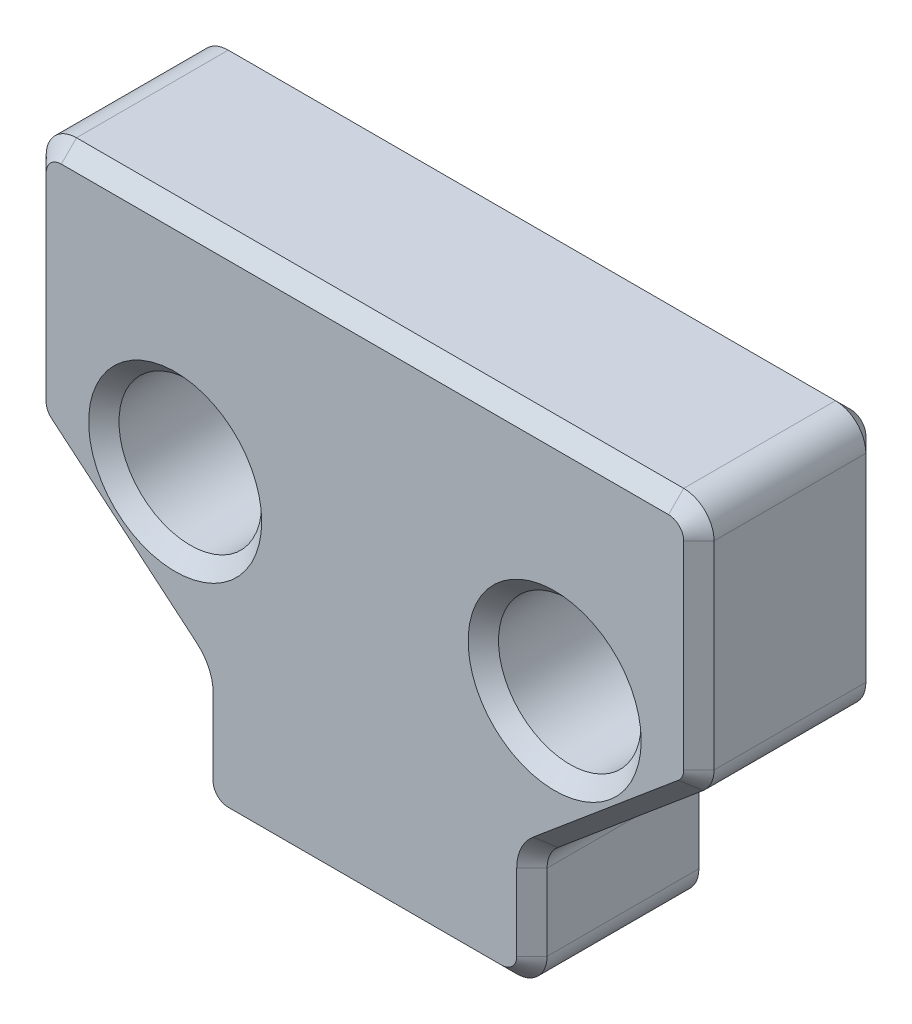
ISO-10303-21;
HEADER;
FILE_DESCRIPTION(('STEP AP214'),'2;1');
FILE_NAME('part.step','',(''),(''),'','','');
FILE_SCHEMA(('AUTOMOTIVE_DESIGN { 1 0 10303 214 1 1 1 1 }'));
ENDSEC;
DATA;
#1=APPLICATION_CONTEXT('core data for automotive mechanical design processes');
#2=APPLICATION_PROTOCOL_DEFINITION('international standard','automotive_design',2000,#1);
#3=PRODUCT_CONTEXT('',#1,'mechanical');
#4=PRODUCT('Part','Part','',(#3));
#5=PRODUCT_RELATED_PRODUCT_CATEGORY('part','',(#4));
#6=PRODUCT_DEFINITION_FORMATION('','',#4);
#7=PRODUCT_DEFINITION_CONTEXT('part definition',#1,'design');
#8=PRODUCT_DEFINITION('design','',#6,#7);
#9=PRODUCT_DEFINITION_SHAPE('','',#8);
#10=(LENGTH_UNIT() NAMED_UNIT(*) SI_UNIT(.MILLI.,.METRE.));
#11=(NAMED_UNIT(*) PLANE_ANGLE_UNIT() SI_UNIT($,.RADIAN.));
#12=(NAMED_UNIT(*) SI_UNIT($,.STERADIAN.) SOLID_ANGLE_UNIT());
#13=UNCERTAINTY_MEASURE_WITH_UNIT(LENGTH_MEASURE(1.E-05),#10,'distance_accuracy_value','');
#14=(GEOMETRIC_REPRESENTATION_CONTEXT(3) GLOBAL_UNCERTAINTY_ASSIGNED_CONTEXT((#13)) GLOBAL_UNIT_ASSIGNED_CONTEXT((#10,
#11,#12)) REPRESENTATION_CONTEXT('',''));
#15=CARTESIAN_POINT('',(0.,0.,0.));
#16=DIRECTION('',(0.,0.,1.));
#17=DIRECTION('',(1.,0.,0.));
#18=AXIS2_PLACEMENT_3D('',#15,#16,#17);
#19=CARTESIAN_POINT('',(0.,0.,6.));
#20=DIRECTION('',(0.,1.,0.));
#21=DIRECTION('',(-1.,0.,0.));
#22=AXIS2_PLACEMENT_3D('',#19,#20,#21);
#23=PLANE('',#22);
#24=DIRECTION('',(0.,0.,-1.));
#25=VECTOR('',#24,1.);
#26=CARTESIAN_POINT('',(10.,0.,6.));
#27=LINE('',#26,#25);
#28=CARTESIAN_POINT('',(10.,0.,0.500000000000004));
#29=VERTEX_POINT('',#28);
#30=CARTESIAN_POINT('',(10.,0.,5.5));
#31=VERTEX_POINT('',#30);
#32=EDGE_CURVE('E509',#29,#31,#27,.F.);
#33=ORIENTED_EDGE('',*,*,#32,.T.);
#34=DIRECTION('',(-1.,0.,0.));
#35=VECTOR('',#34,1.);
#36=CARTESIAN_POINT('',(1.,0.,5.5));
#37=LINE('',#36,#35);
#38=CARTESIAN_POINT('',(1.,0.,5.5));
#39=VERTEX_POINT('',#38);
#40=EDGE_CURVE('E324',#31,#39,#37,.T.);
#41=ORIENTED_EDGE('',*,*,#40,.T.);
#42=DIRECTION('',(0.,0.,-1.));
#43=VECTOR('',#42,1.);
#44=CARTESIAN_POINT('',(1.,0.,6.));
#45=LINE('',#44,#43);
#46=CARTESIAN_POINT('',(1.,0.,0.500000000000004));
#47=VERTEX_POINT('',#46);
#48=EDGE_CURVE('E513',#39,#47,#45,.T.);
#49=ORIENTED_EDGE('',*,*,#48,.T.);
#50=DIRECTION('',(1.,0.,0.));
#51=VECTOR('',#50,1.);
#52=CARTESIAN_POINT('',(0.,0.,0.500000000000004));
#53=LINE('',#52,#51);
#54=EDGE_CURVE('E322',#47,#29,#53,.T.);
#55=ORIENTED_EDGE('',*,*,#54,.T.);
#56=EDGE_LOOP('',(#33,#41,#49,#55));
#57=FACE_BOUND('',#56,.T.);
#58=ADVANCED_FACE('F42',(#57),#23,.F.);
#59=CARTESIAN_POINT('',(11.,0.,6.));
#60=DIRECTION('',(-1.,0.,0.));
#61=DIRECTION('',(0.,0.,1.));
#62=AXIS2_PLACEMENT_3D('',#59,#60,#61);
#63=PLANE('',#62);
#64=DIRECTION('',(0.,0.,-1.));
#65=VECTOR('',#64,1.);
#66=CARTESIAN_POINT('',(11.,3.51864437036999,6.));
#67=LINE('',#66,#65);
#68=CARTESIAN_POINT('',(11.,3.51864437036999,0.500000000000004));
#69=VERTEX_POINT('',#68);
#70=CARTESIAN_POINT('',(11.,3.51864437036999,5.5));
#71=VERTEX_POINT('',#70);
#72=EDGE_CURVE('E521',#69,#71,#67,.F.);
#73=ORIENTED_EDGE('',*,*,#72,.T.);
#74=DIRECTION('',(0.,-1.,0.));
#75=VECTOR('',#74,1.);
#76=CARTESIAN_POINT('',(11.,1.,5.5));
#77=LINE('',#76,#75);
#78=CARTESIAN_POINT('',(11.,1.,5.5));
#79=VERTEX_POINT('',#78);
#80=EDGE_CURVE('E316',#71,#79,#77,.T.);
#81=ORIENTED_EDGE('',*,*,#80,.T.);
#82=DIRECTION('',(0.,0.,-1.));
#83=VECTOR('',#82,1.);
#84=CARTESIAN_POINT('',(11.,1.,6.));
#85=LINE('',#84,#83);
#86=CARTESIAN_POINT('',(11.,1.,0.500000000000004));
#87=VERTEX_POINT('',#86);
#88=EDGE_CURVE('E524',#79,#87,#85,.T.);
#89=ORIENTED_EDGE('',*,*,#88,.T.);
#90=DIRECTION('',(0.,1.,0.));
#91=VECTOR('',#90,1.);
#92=CARTESIAN_POINT('',(11.,0.,0.500000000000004));
#93=LINE('',#92,#91);
#94=EDGE_CURVE('E313',#87,#69,#93,.T.);
#95=ORIENTED_EDGE('',*,*,#94,.T.);
#96=EDGE_LOOP('',(#73,#81,#89,#95));
#97=FACE_BOUND('',#96,.T.);
#98=ADVANCED_FACE('F645',(#97),#63,.F.);
#99=CARTESIAN_POINT('',(11.,3.98495202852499,6.));
#100=DIRECTION('',(-0.642787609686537,0.76604444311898,0.));
#101=DIRECTION('',(-0.76604444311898,-0.642787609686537,0.));
#102=AXIS2_PLACEMENT_3D('',#99,#100,#101);
#103=PLANE('',#102);
#104=DIRECTION('',(0.,0.,-1.));
#105=VECTOR('',#104,1.);
#106=CARTESIAN_POINT('',(16.1427876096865,8.30026321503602,6.));
#107=LINE('',#106,#105);
#108=CARTESIAN_POINT('',(16.1427876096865,8.30026321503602,0.500000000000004));
#109=VERTEX_POINT('',#108);
#110=CARTESIAN_POINT('',(16.1427876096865,8.30026321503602,5.49999999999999));
#111=VERTEX_POINT('',#110);
#112=EDGE_CURVE('E527',#109,#111,#107,.F.);
#113=ORIENTED_EDGE('',*,*,#112,.T.);
#114=DIRECTION('',(-0.76604444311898,-0.642787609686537,0.));
#115=VECTOR('',#114,1.);
#116=CARTESIAN_POINT('',(11.3572123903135,4.28468881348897,5.49999999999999));
#117=LINE('',#116,#115);
#118=CARTESIAN_POINT('',(11.3572123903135,4.28468881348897,5.5));
#119=VERTEX_POINT('',#118);
#120=EDGE_CURVE('E307',#111,#119,#117,.T.);
#121=ORIENTED_EDGE('',*,*,#120,.T.);
#122=DIRECTION('',(0.,0.,-1.));
#123=VECTOR('',#122,1.);
#124=CARTESIAN_POINT('',(11.3572123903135,4.28468881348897,0.));
#125=LINE('',#124,#123);
#126=CARTESIAN_POINT('',(11.3572123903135,4.28468881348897,0.500000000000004));
#127=VERTEX_POINT('',#126);
#128=EDGE_CURVE('E530',#119,#127,#125,.T.);
#129=ORIENTED_EDGE('',*,*,#128,.T.);
#130=DIRECTION('',(0.76604444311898,0.642787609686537,0.));
#131=VECTOR('',#130,1.);
#132=CARTESIAN_POINT('',(11.,3.98495202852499,0.500000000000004));
#133=LINE('',#132,#131);
#134=EDGE_CURVE('E305',#127,#109,#133,.T.);
#135=ORIENTED_EDGE('',*,*,#134,.T.);
#136=EDGE_LOOP('',(#113,#121,#129,#135));
#137=FACE_BOUND('',#136,.T.);
#138=ADVANCED_FACE('F691',(#137),#103,.F.);
#139=CARTESIAN_POINT('',(16.5,8.6,6.));
#140=DIRECTION('',(-1.,0.,0.));
#141=DIRECTION('',(0.,-1.,0.));
#142=AXIS2_PLACEMENT_3D('',#139,#140,#141);
#143=PLANE('',#142);
#144=DIRECTION('',(0.,0.,-1.));
#145=VECTOR('',#144,1.);
#146=CARTESIAN_POINT('',(16.5,15.6,6.));
#147=LINE('',#146,#145);
#148=CARTESIAN_POINT('',(16.5,15.6,0.500000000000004));
#149=VERTEX_POINT('',#148);
#150=CARTESIAN_POINT('',(16.5,15.6,5.5));
#151=VERTEX_POINT('',#150);
#152=EDGE_CURVE('E533',#149,#151,#147,.F.);
#153=ORIENTED_EDGE('',*,*,#152,.T.);
#154=DIRECTION('',(0.,-1.,0.));
#155=VECTOR('',#154,1.);
#156=CARTESIAN_POINT('',(16.5,9.066307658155,5.5));
#157=LINE('',#156,#155);
#158=CARTESIAN_POINT('',(16.5,9.066307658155,5.5));
#159=VERTEX_POINT('',#158);
#160=EDGE_CURVE('E299',#151,#159,#157,.T.);
#161=ORIENTED_EDGE('',*,*,#160,.T.);
#162=DIRECTION('',(0.,0.,-1.));
#163=VECTOR('',#162,1.);
#164=CARTESIAN_POINT('',(16.5,9.066307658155,6.));
#165=LINE('',#164,#163);
#166=CARTESIAN_POINT('',(16.5,9.066307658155,0.500000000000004));
#167=VERTEX_POINT('',#166);
#168=EDGE_CURVE('E536',#159,#167,#165,.T.);
#169=ORIENTED_EDGE('',*,*,#168,.T.);
#170=DIRECTION('',(0.,1.,0.));
#171=VECTOR('',#170,1.);
#172=CARTESIAN_POINT('',(16.5,8.6,0.500000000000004));
#173=LINE('',#172,#171);
#174=EDGE_CURVE('E297',#167,#149,#173,.T.);
#175=ORIENTED_EDGE('',*,*,#174,.T.);
#176=EDGE_LOOP('',(#153,#161,#169,#175));
#177=FACE_BOUND('',#176,.T.);
#178=ADVANCED_FACE('F1095',(#177),#143,.F.);
#179=CARTESIAN_POINT('',(-5.5,16.6,6.));
#180=DIRECTION('',(0.,-1.,0.));
#181=DIRECTION('',(1.,0.,0.));
#182=AXIS2_PLACEMENT_3D('',#179,#180,#181);
#183=PLANE('',#182);
#184=DIRECTION('',(0.,0.,-1.));
#185=VECTOR('',#184,1.);
#186=CARTESIAN_POINT('',(-4.5,16.6,6.));
#187=LINE('',#186,#185);
#188=CARTESIAN_POINT('',(-4.5,16.6,0.500000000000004));
#189=VERTEX_POINT('',#188);
#190=CARTESIAN_POINT('',(-4.5,16.6,5.5));
#191=VERTEX_POINT('',#190);
#192=EDGE_CURVE('E542',#189,#191,#187,.F.);
#193=ORIENTED_EDGE('',*,*,#192,.T.);
#194=DIRECTION('',(1.,0.,0.));
#195=VECTOR('',#194,1.);
#196=CARTESIAN_POINT('',(15.5,16.6,5.5));
#197=LINE('',#196,#195);
#198=CARTESIAN_POINT('',(15.5,16.6,5.5));
#199=VERTEX_POINT('',#198);
#200=EDGE_CURVE('E291',#191,#199,#197,.T.);
#201=ORIENTED_EDGE('',*,*,#200,.T.);
#202=DIRECTION('',(0.,0.,-1.));
#203=VECTOR('',#202,1.);
#204=CARTESIAN_POINT('',(15.5,16.6,6.));
#205=LINE('',#204,#203);
#206=CARTESIAN_POINT('',(15.5,16.6,0.500000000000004));
#207=VERTEX_POINT('',#206);
#208=EDGE_CURVE('E539',#199,#207,#205,.T.);
#209=ORIENTED_EDGE('',*,*,#208,.T.);
#210=DIRECTION('',(-1.,0.,0.));
#211=VECTOR('',#210,1.);
#212=CARTESIAN_POINT('',(-5.5,16.6,0.500000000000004));
#213=LINE('',#212,#211);
#214=EDGE_CURVE('E289',#207,#189,#213,.T.);
#215=ORIENTED_EDGE('',*,*,#214,.T.);
#216=EDGE_LOOP('',(#193,#201,#209,#215));
#217=FACE_BOUND('',#216,.T.);
#218=ADVANCED_FACE('F598',(#217),#183,.F.);
#219=CARTESIAN_POINT('',(-5.5,8.6,6.));
#220=DIRECTION('',(1.,0.,0.));
#221=DIRECTION('',(0.,0.,-1.));
#222=AXIS2_PLACEMENT_3D('',#219,#220,#221);
#223=PLANE('',#222);
#224=DIRECTION('',(0.,0.,-1.));
#225=VECTOR('',#224,1.);
#226=CARTESIAN_POINT('',(-5.5,9.066307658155,6.));
#227=LINE('',#226,#225);
#228=CARTESIAN_POINT('',(-5.5,9.066307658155,0.500000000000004));
#229=VERTEX_POINT('',#228);
#230=CARTESIAN_POINT('',(-5.5,9.066307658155,5.5));
#231=VERTEX_POINT('',#230);
#232=EDGE_CURVE('E515',#229,#231,#227,.F.);
#233=ORIENTED_EDGE('',*,*,#232,.T.);
#234=DIRECTION('',(0.,1.,0.));
#235=VECTOR('',#234,1.);
#236=CARTESIAN_POINT('',(-5.5,15.6,5.5));
#237=LINE('',#236,#235);
#238=CARTESIAN_POINT('',(-5.5,15.6,5.5));
#239=VERTEX_POINT('',#238);
#240=EDGE_CURVE('E348',#231,#239,#237,.T.);
#241=ORIENTED_EDGE('',*,*,#240,.T.);
#242=DIRECTION('',(0.,0.,-1.));
#243=VECTOR('',#242,1.);
#244=CARTESIAN_POINT('',(-5.5,15.6,6.));
#245=LINE('',#244,#243);
#246=CARTESIAN_POINT('',(-5.5,15.6,0.500000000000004));
#247=VERTEX_POINT('',#246);
#248=EDGE_CURVE('E597',#239,#247,#245,.T.);
#249=ORIENTED_EDGE('',*,*,#248,.T.);
#250=DIRECTION('',(0.,-1.,0.));
#251=VECTOR('',#250,1.);
#252=CARTESIAN_POINT('',(-5.5,8.6,0.500000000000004));
#253=LINE('',#252,#251);
#254=EDGE_CURVE('E346',#247,#229,#253,.T.);
#255=ORIENTED_EDGE('',*,*,#254,.T.);
#256=EDGE_LOOP('',(#233,#241,#249,#255));
#257=FACE_BOUND('',#256,.T.);
#258=ADVANCED_FACE('F1080',(#257),#223,.F.);
#259=CARTESIAN_POINT('',(0.,3.98495202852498,6.));
#260=DIRECTION('',(0.642787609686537,0.76604444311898,0.));
#261=DIRECTION('',(-0.76604444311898,0.642787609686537,0.));
#262=AXIS2_PLACEMENT_3D('',#259,#260,#261);
#263=PLANE('',#262);
#264=DIRECTION('',(0.,0.,-1.));
#265=VECTOR('',#264,1.);
#266=CARTESIAN_POINT('',(-0.357212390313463,4.28468881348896,6.));
#267=LINE('',#266,#265);
#268=CARTESIAN_POINT('',(-0.357212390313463,4.28468881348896,0.500000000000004));
#269=VERTEX_POINT('',#268);
#270=CARTESIAN_POINT('',(-0.357212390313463,4.28468881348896,5.5));
#271=VERTEX_POINT('',#270);
#272=EDGE_CURVE('E503',#269,#271,#267,.F.);
#273=ORIENTED_EDGE('',*,*,#272,.T.);
#274=DIRECTION('',(-0.76604444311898,0.642787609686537,0.));
#275=VECTOR('',#274,1.);
#276=CARTESIAN_POINT('',(-5.14278760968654,8.30026321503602,5.5));
#277=LINE('',#276,#275);
#278=CARTESIAN_POINT('',(-5.14278760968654,8.30026321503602,5.5));
#279=VERTEX_POINT('',#278);
#280=EDGE_CURVE('E340',#271,#279,#277,.T.);
#281=ORIENTED_EDGE('',*,*,#280,.T.);
#282=DIRECTION('',(0.,0.,-1.));
#283=VECTOR('',#282,1.);
#284=CARTESIAN_POINT('',(-5.14278760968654,8.30026321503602,6.));
#285=LINE('',#284,#283);
#286=CARTESIAN_POINT('',(-5.14278760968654,8.30026321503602,0.500000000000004));
#287=VERTEX_POINT('',#286);
#288=EDGE_CURVE('E1316',#279,#287,#285,.T.);
#289=ORIENTED_EDGE('',*,*,#288,.T.);
#290=DIRECTION('',(0.76604444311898,-0.642787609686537,0.));
#291=VECTOR('',#290,1.);
#292=CARTESIAN_POINT('',(0.,3.98495202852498,0.500000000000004));
#293=LINE('',#292,#291);
#294=EDGE_CURVE('E338',#287,#269,#293,.T.);
#295=ORIENTED_EDGE('',*,*,#294,.T.);
#296=EDGE_LOOP('',(#273,#281,#289,#295));
#297=FACE_BOUND('',#296,.T.);
#298=ADVANCED_FACE('F1073',(#297),#263,.F.);
#299=CARTESIAN_POINT('',(0.,0.,6.));
#300=DIRECTION('',(1.,0.,0.));
#301=DIRECTION('',(0.,0.,-1.));
#302=AXIS2_PLACEMENT_3D('',#299,#300,#301);
#303=PLANE('',#302);
#304=DIRECTION('',(0.,0.,-1.));
#305=VECTOR('',#304,1.);
#306=CARTESIAN_POINT('',(0.,1.,6.));
#307=LINE('',#306,#305);
#308=CARTESIAN_POINT('',(0.,1.,0.500000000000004));
#309=VERTEX_POINT('',#308);
#310=CARTESIAN_POINT('',(0.,1.,5.5));
#311=VERTEX_POINT('',#310);
#312=EDGE_CURVE('E510',#309,#311,#307,.F.);
#313=ORIENTED_EDGE('',*,*,#312,.T.);
#314=DIRECTION('',(0.,1.,0.));
#315=VECTOR('',#314,1.);
#316=CARTESIAN_POINT('',(0.,3.51864437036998,5.5));
#317=LINE('',#316,#315);
#318=CARTESIAN_POINT('',(0.,3.51864437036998,5.5));
#319=VERTEX_POINT('',#318);
#320=EDGE_CURVE('E332',#311,#319,#317,.T.);
#321=ORIENTED_EDGE('',*,*,#320,.T.);
#322=DIRECTION('',(0.,0.,-1.));
#323=VECTOR('',#322,1.);
#324=CARTESIAN_POINT('',(0.,3.51864437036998,0.));
#325=LINE('',#324,#323);
#326=CARTESIAN_POINT('',(0.,3.51864437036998,0.500000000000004));
#327=VERTEX_POINT('',#326);
#328=EDGE_CURVE('E500',#319,#327,#325,.T.);
#329=ORIENTED_EDGE('',*,*,#328,.T.);
#330=DIRECTION('',(0.,-1.,0.));
#331=VECTOR('',#330,1.);
#332=CARTESIAN_POINT('',(0.,0.,0.500000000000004));
#333=LINE('',#332,#331);
#334=EDGE_CURVE('E330',#327,#309,#333,.T.);
#335=ORIENTED_EDGE('',*,*,#334,.T.);
#336=EDGE_LOOP('',(#313,#321,#329,#335));
#337=FACE_BOUND('',#336,.T.);
#338=ADVANCED_FACE('F506',(#337),#303,.F.);
#339=CARTESIAN_POINT('',(0.,0.,6.));
#340=DIRECTION('',(0.,0.,1.));
#341=DIRECTION('',(1.,0.,0.));
#342=AXIS2_PLACEMENT_3D('',#339,#340,#341);
#343=PLANE('',#342);
#344=DIRECTION('',(-1.,0.,0.));
#345=VECTOR('',#344,1.);
#346=CARTESIAN_POINT('',(-4.5,16.1,6.));
#347=LINE('',#346,#345);
#348=CARTESIAN_POINT('',(15.5,16.1,6.));
#349=VERTEX_POINT('',#348);
#350=CARTESIAN_POINT('',(-4.5,16.1,6.));
#351=VERTEX_POINT('',#350);
#352=EDGE_CURVE('E279',#349,#351,#347,.T.);
#353=ORIENTED_EDGE('',*,*,#352,.T.);
#354=CARTESIAN_POINT('',(-4.5,15.6,6.));
#355=DIRECTION('',(0.,0.,1.));
#356=DIRECTION('',(1.,0.,0.));
#357=AXIS2_PLACEMENT_3D('',#354,#355,#356);
#358=CIRCLE('',#357,0.499999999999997);
#359=CARTESIAN_POINT('',(-5.,15.6,6.));
#360=VERTEX_POINT('',#359);
#361=EDGE_CURVE('E259',#351,#360,#358,.T.);
#362=ORIENTED_EDGE('',*,*,#361,.T.);
#363=DIRECTION('',(0.,-1.,0.));
#364=VECTOR('',#363,1.);
#365=CARTESIAN_POINT('',(-5.,9.066307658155,6.));
#366=LINE('',#365,#364);
#367=CARTESIAN_POINT('',(-5.,9.066307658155,6.));
#368=VERTEX_POINT('',#367);
#369=EDGE_CURVE('E267',#360,#368,#366,.T.);
#370=ORIENTED_EDGE('',*,*,#369,.T.);
#371=CARTESIAN_POINT('',(-4.5,9.066307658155,6.));
#372=DIRECTION('',(0.,0.,1.));
#373=DIRECTION('',(1.,0.,0.));
#374=AXIS2_PLACEMENT_3D('',#371,#372,#373);
#375=CIRCLE('',#374,0.499999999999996);
#376=CARTESIAN_POINT('',(-4.82139380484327,8.68328543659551,6.));
#377=VERTEX_POINT('',#376);
#378=EDGE_CURVE('E273',#368,#377,#375,.T.);
#379=ORIENTED_EDGE('',*,*,#378,.T.);
#380=DIRECTION('',(0.76604444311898,-0.642787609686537,0.));
#381=VECTOR('',#380,1.);
#382=CARTESIAN_POINT('',(-0.0358185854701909,4.66771103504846,6.));
#383=LINE('',#382,#381);
#384=CARTESIAN_POINT('',(-0.0358185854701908,4.66771103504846,6.));
#385=VERTEX_POINT('',#384);
#386=EDGE_CURVE('E559',#377,#385,#383,.T.);
#387=ORIENTED_EDGE('',*,*,#386,.T.);
#388=CARTESIAN_POINT('',(-1.,3.51864437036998,6.));
#389=DIRECTION('',(0.,0.,1.));
#390=DIRECTION('',(1.,0.,0.));
#391=AXIS2_PLACEMENT_3D('',#388,#389,#390);
#392=CIRCLE('',#391,1.5);
#393=CARTESIAN_POINT('',(0.500000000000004,3.51864437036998,6.));
#394=VERTEX_POINT('',#393);
#395=EDGE_CURVE('E561',#385,#394,#392,.F.);
#396=ORIENTED_EDGE('',*,*,#395,.T.);
#397=DIRECTION('',(0.,-1.,0.));
#398=VECTOR('',#397,1.);
#399=CARTESIAN_POINT('',(0.500000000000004,1.,6.));
#400=LINE('',#399,#398);
#401=CARTESIAN_POINT('',(0.500000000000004,1.,6.));
#402=VERTEX_POINT('',#401);
#403=EDGE_CURVE('E563',#394,#402,#400,.T.);
#404=ORIENTED_EDGE('',*,*,#403,.T.);
#405=CARTESIAN_POINT('',(1.,1.,6.));
#406=DIRECTION('',(0.,0.,1.));
#407=DIRECTION('',(1.,0.,0.));
#408=AXIS2_PLACEMENT_3D('',#405,#406,#407);
#409=CIRCLE('',#408,0.499999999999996);
#410=CARTESIAN_POINT('',(1.,0.500000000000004,6.));
#411=VERTEX_POINT('',#410);
#412=EDGE_CURVE('E565',#402,#411,#409,.T.);
#413=ORIENTED_EDGE('',*,*,#412,.T.);
#414=DIRECTION('',(1.,0.,0.));
#415=VECTOR('',#414,1.);
#416=CARTESIAN_POINT('',(10.,0.500000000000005,6.));
#417=LINE('',#416,#415);
#418=CARTESIAN_POINT('',(10.,0.500000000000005,6.));
#419=VERTEX_POINT('',#418);
#420=EDGE_CURVE('E567',#411,#419,#417,.T.);
#421=ORIENTED_EDGE('',*,*,#420,.T.);
#422=CARTESIAN_POINT('',(10.,1.,6.));
#423=DIRECTION('',(0.,0.,1.));
#424=DIRECTION('',(1.,0.,0.));
#425=AXIS2_PLACEMENT_3D('',#422,#423,#424);
#426=CIRCLE('',#425,0.499999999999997);
#427=CARTESIAN_POINT('',(10.5,1.,6.));
#428=VERTEX_POINT('',#427);
#429=EDGE_CURVE('E569',#419,#428,#426,.T.);
#430=ORIENTED_EDGE('',*,*,#429,.T.);
#431=DIRECTION('',(0.,1.,0.));
#432=VECTOR('',#431,1.);
#433=CARTESIAN_POINT('',(10.5,3.51864437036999,6.));
#434=LINE('',#433,#432);
#435=CARTESIAN_POINT('',(10.5,3.51864437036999,6.));
#436=VERTEX_POINT('',#435);
#437=EDGE_CURVE('E571',#428,#436,#434,.T.);
#438=ORIENTED_EDGE('',*,*,#437,.T.);
#439=CARTESIAN_POINT('',(12.,3.51864437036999,6.));
#440=DIRECTION('',(0.,0.,1.));
#441=DIRECTION('',(1.,0.,0.));
#442=AXIS2_PLACEMENT_3D('',#439,#440,#441);
#443=CIRCLE('',#442,1.5);
#444=CARTESIAN_POINT('',(11.0358185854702,4.66771103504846,6.));
#445=VERTEX_POINT('',#444);
#446=EDGE_CURVE('E573',#436,#445,#443,.F.);
#447=ORIENTED_EDGE('',*,*,#446,.T.);
#448=DIRECTION('',(0.76604444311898,0.642787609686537,0.));
#449=VECTOR('',#448,1.);
#450=CARTESIAN_POINT('',(15.8213938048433,8.68328543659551,6.));
#451=LINE('',#450,#449);
#452=CARTESIAN_POINT('',(15.8213938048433,8.68328543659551,6.));
#453=VERTEX_POINT('',#452);
#454=EDGE_CURVE('E575',#445,#453,#451,.T.);
#455=ORIENTED_EDGE('',*,*,#454,.T.);
#456=CARTESIAN_POINT('',(15.5,9.066307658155,6.));
#457=DIRECTION('',(0.,0.,1.));
#458=DIRECTION('',(1.,0.,0.));
#459=AXIS2_PLACEMENT_3D('',#456,#457,#458);
#460=CIRCLE('',#459,0.499999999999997);
#461=CARTESIAN_POINT('',(16.,9.066307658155,6.));
#462=VERTEX_POINT('',#461);
#463=EDGE_CURVE('E577',#453,#462,#460,.T.);
#464=ORIENTED_EDGE('',*,*,#463,.T.);
#465=DIRECTION('',(0.,1.,0.));
#466=VECTOR('',#465,1.);
#467=CARTESIAN_POINT('',(16.,15.6,6.));
#468=LINE('',#467,#466);
#469=CARTESIAN_POINT('',(16.,15.6,6.));
#470=VERTEX_POINT('',#469);
#471=EDGE_CURVE('E579',#462,#470,#468,.T.);
#472=ORIENTED_EDGE('',*,*,#471,.T.);
#473=CARTESIAN_POINT('',(15.5,15.6,6.));
#474=DIRECTION('',(0.,0.,1.));
#475=DIRECTION('',(1.,0.,0.));
#476=AXIS2_PLACEMENT_3D('',#473,#474,#475);
#477=CIRCLE('',#476,0.499999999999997);
#478=EDGE_CURVE('E284',#470,#349,#477,.T.);
#479=ORIENTED_EDGE('',*,*,#478,.T.);
#480=EDGE_LOOP('',(#353,#362,#370,#379,#387,#396,#404,#413,#421,#430,#438,#447,#455,#464,#472,#479));
#481=FACE_BOUND('',#480,.T.);
#482=CARTESIAN_POINT('',(11.75,9.2,6.));
#483=DIRECTION('',(0.,0.,1.));
#484=DIRECTION('',(1.,0.,0.));
#485=AXIS2_PLACEMENT_3D('',#482,#483,#484);
#486=CIRCLE('',#485,2.84999999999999);
#487=CARTESIAN_POINT('',(14.6,9.2,6.));
#488=VERTEX_POINT('',#487);
#489=EDGE_CURVE('E274',#488,#488,#486,.F.);
#490=ORIENTED_EDGE('',*,*,#489,.T.);
#491=EDGE_LOOP('',(#490));
#492=FACE_BOUND('',#491,.T.);
#493=CARTESIAN_POINT('',(-0.750000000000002,9.2,6.));
#494=DIRECTION('',(0.,0.,1.));
#495=DIRECTION('',(1.,0.,0.));
#496=AXIS2_PLACEMENT_3D('',#493,#494,#495);
#497=CIRCLE('',#496,2.84999999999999);
#498=CARTESIAN_POINT('',(2.09999999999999,9.2,6.));
#499=VERTEX_POINT('',#498);
#500=EDGE_CURVE('E545',#499,#499,#497,.F.);
#501=ORIENTED_EDGE('',*,*,#500,.T.);
#502=EDGE_LOOP('',(#501));
#503=FACE_BOUND('',#502,.T.);
#504=ADVANCED_FACE('F276',(#481,#492,#503),#343,.T.);
#505=CARTESIAN_POINT('',(0.,0.,0.));
#506=DIRECTION('',(0.,0.,1.));
#507=DIRECTION('',(1.,0.,0.));
#508=AXIS2_PLACEMENT_3D('',#505,#506,#507);
#509=PLANE('',#508);
#510=CARTESIAN_POINT('',(12.,3.51864437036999,0.));
#511=DIRECTION('',(0.,0.,1.));
#512=DIRECTION('',(1.,0.,0.));
#513=AXIS2_PLACEMENT_3D('',#510,#511,#512);
#514=CIRCLE('',#513,1.5);
#515=CARTESIAN_POINT('',(11.0358185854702,4.66771103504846,0.));
#516=VERTEX_POINT('',#515);
#517=CARTESIAN_POINT('',(10.5,3.51864437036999,0.));
#518=VERTEX_POINT('',#517);
#519=EDGE_CURVE('E52',#516,#518,#514,.T.);
#520=ORIENTED_EDGE('',*,*,#519,.T.);
#521=DIRECTION('',(0.,-1.,0.));
#522=VECTOR('',#521,1.);
#523=CARTESIAN_POINT('',(10.5,0.,0.));
#524=LINE('',#523,#522);
#525=CARTESIAN_POINT('',(10.5,1.,0.));
#526=VERTEX_POINT('',#525);
#527=EDGE_CURVE('E11',#518,#526,#524,.T.);
#528=ORIENTED_EDGE('',*,*,#527,.T.);
#529=CARTESIAN_POINT('',(10.,1.,0.));
#530=DIRECTION('',(0.,0.,1.));
#531=DIRECTION('',(1.,0.,0.));
#532=AXIS2_PLACEMENT_3D('',#529,#530,#531);
#533=CIRCLE('',#532,0.499999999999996);
#534=CARTESIAN_POINT('',(10.,0.500000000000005,0.));
#535=VERTEX_POINT('',#534);
#536=EDGE_CURVE('E382',#526,#535,#533,.F.);
#537=ORIENTED_EDGE('',*,*,#536,.T.);
#538=DIRECTION('',(-1.,0.,0.));
#539=VECTOR('',#538,1.);
#540=CARTESIAN_POINT('',(0.,0.500000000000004,0.));
#541=LINE('',#540,#539);
#542=CARTESIAN_POINT('',(1.,0.500000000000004,0.));
#543=VERTEX_POINT('',#542);
#544=EDGE_CURVE('E378',#535,#543,#541,.T.);
#545=ORIENTED_EDGE('',*,*,#544,.T.);
#546=CARTESIAN_POINT('',(1.,1.,0.));
#547=DIRECTION('',(0.,0.,1.));
#548=DIRECTION('',(1.,0.,0.));
#549=AXIS2_PLACEMENT_3D('',#546,#547,#548);
#550=CIRCLE('',#549,0.499999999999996);
#551=CARTESIAN_POINT('',(0.500000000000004,1.,0.));
#552=VERTEX_POINT('',#551);
#553=EDGE_CURVE('E374',#543,#552,#550,.F.);
#554=ORIENTED_EDGE('',*,*,#553,.T.);
#555=DIRECTION('',(0.,1.,0.));
#556=VECTOR('',#555,1.);
#557=CARTESIAN_POINT('',(0.500000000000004,0.,0.));
#558=LINE('',#557,#556);
#559=CARTESIAN_POINT('',(0.500000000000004,3.51864437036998,0.));
#560=VERTEX_POINT('',#559);
#561=EDGE_CURVE('E370',#552,#560,#558,.T.);
#562=ORIENTED_EDGE('',*,*,#561,.T.);
#563=CARTESIAN_POINT('',(-1.,3.51864437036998,0.));
#564=DIRECTION('',(0.,0.,1.));
#565=DIRECTION('',(1.,0.,0.));
#566=AXIS2_PLACEMENT_3D('',#563,#564,#565);
#567=CIRCLE('',#566,1.5);
#568=CARTESIAN_POINT('',(-0.0358185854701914,4.66771103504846,0.));
#569=VERTEX_POINT('',#568);
#570=EDGE_CURVE('E366',#560,#569,#567,.T.);
#571=ORIENTED_EDGE('',*,*,#570,.T.);
#572=DIRECTION('',(-0.76604444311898,0.642787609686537,0.));
#573=VECTOR('',#572,1.);
#574=CARTESIAN_POINT('',(2.28359963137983,2.72148806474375,0.));
#575=LINE('',#574,#573);
#576=CARTESIAN_POINT('',(-4.82139380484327,8.68328543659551,0.));
#577=VERTEX_POINT('',#576);
#578=EDGE_CURVE('E362',#569,#577,#575,.T.);
#579=ORIENTED_EDGE('',*,*,#578,.T.);
#580=CARTESIAN_POINT('',(-4.5,9.066307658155,0.));
#581=DIRECTION('',(0.,0.,1.));
#582=DIRECTION('',(1.,0.,0.));
#583=AXIS2_PLACEMENT_3D('',#580,#581,#582);
#584=CIRCLE('',#583,0.499999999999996);
#585=CARTESIAN_POINT('',(-5.,9.066307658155,0.));
#586=VERTEX_POINT('',#585);
#587=EDGE_CURVE('E358',#577,#586,#584,.F.);
#588=ORIENTED_EDGE('',*,*,#587,.T.);
#589=DIRECTION('',(0.,1.,0.));
#590=VECTOR('',#589,1.);
#591=CARTESIAN_POINT('',(-5.,0.,0.));
#592=LINE('',#591,#590);
#593=CARTESIAN_POINT('',(-5.,15.6,0.));
#594=VERTEX_POINT('',#593);
#595=EDGE_CURVE('E356',#586,#594,#592,.T.);
#596=ORIENTED_EDGE('',*,*,#595,.T.);
#597=CARTESIAN_POINT('',(-4.5,15.6,0.));
#598=DIRECTION('',(0.,0.,1.));
#599=DIRECTION('',(1.,0.,0.));
#600=AXIS2_PLACEMENT_3D('',#597,#598,#599);
#601=CIRCLE('',#600,0.499999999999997);
#602=CARTESIAN_POINT('',(-4.5,16.1,0.));
#603=VERTEX_POINT('',#602);
#604=EDGE_CURVE('E360',#594,#603,#601,.F.);
#605=ORIENTED_EDGE('',*,*,#604,.T.);
#606=DIRECTION('',(1.,0.,0.));
#607=VECTOR('',#606,1.);
#608=CARTESIAN_POINT('',(0.,16.1,0.));
#609=LINE('',#608,#607);
#610=CARTESIAN_POINT('',(15.5,16.1,0.));
#611=VERTEX_POINT('',#610);
#612=EDGE_CURVE('E364',#603,#611,#609,.T.);
#613=ORIENTED_EDGE('',*,*,#612,.T.);
#614=CARTESIAN_POINT('',(15.5,15.6,0.));
#615=DIRECTION('',(0.,0.,1.));
#616=DIRECTION('',(1.,0.,0.));
#617=AXIS2_PLACEMENT_3D('',#614,#615,#616);
#618=CIRCLE('',#617,0.499999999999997);
#619=CARTESIAN_POINT('',(16.,15.6,0.));
#620=VERTEX_POINT('',#619);
#621=EDGE_CURVE('E368',#611,#620,#618,.F.);
#622=ORIENTED_EDGE('',*,*,#621,.T.);
#623=DIRECTION('',(0.,-1.,0.));
#624=VECTOR('',#623,1.);
#625=CARTESIAN_POINT('',(16.,0.,0.));
#626=LINE('',#625,#624);
#627=CARTESIAN_POINT('',(16.,9.066307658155,0.));
#628=VERTEX_POINT('',#627);
#629=EDGE_CURVE('E372',#620,#628,#626,.T.);
#630=ORIENTED_EDGE('',*,*,#629,.T.);
#631=CARTESIAN_POINT('',(15.5,9.066307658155,0.));
#632=DIRECTION('',(0.,0.,1.));
#633=DIRECTION('',(1.,0.,0.));
#634=AXIS2_PLACEMENT_3D('',#631,#632,#633);
#635=CIRCLE('',#634,0.499999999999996);
#636=CARTESIAN_POINT('',(15.8213938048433,8.68328543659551,0.));
#637=VERTEX_POINT('',#636);
#638=EDGE_CURVE('E376',#628,#637,#635,.F.);
#639=ORIENTED_EDGE('',*,*,#638,.T.);
#640=DIRECTION('',(-0.76604444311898,-0.642787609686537,0.));
#641=VECTOR('',#640,1.);
#642=CARTESIAN_POINT('',(2.26133539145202,-2.69495457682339,0.));
#643=LINE('',#642,#641);
#644=EDGE_CURVE('E380',#637,#516,#643,.T.);
#645=ORIENTED_EDGE('',*,*,#644,.T.);
#646=EDGE_LOOP('',(#520,#528,#537,#545,#554,#562,#571,#579,#588,#596,#605,#613,#622,#630,#639,#645));
#647=FACE_BOUND('',#646,.T.);
#648=CARTESIAN_POINT('',(-0.750000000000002,9.2,0.));
#649=DIRECTION('',(0.,0.,1.));
#650=DIRECTION('',(1.,0.,0.));
#651=AXIS2_PLACEMENT_3D('',#648,#649,#650);
#652=CIRCLE('',#651,1.7);
#653=CARTESIAN_POINT('',(0.949999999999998,9.2,0.));
#654=VERTEX_POINT('',#653);
#655=EDGE_CURVE('E1317',#654,#654,#652,.T.);
#656=ORIENTED_EDGE('',*,*,#655,.T.);
#657=EDGE_LOOP('',(#656));
#658=FACE_BOUND('',#657,.T.);
#659=CARTESIAN_POINT('',(11.75,9.2,0.));
#660=DIRECTION('',(0.,0.,1.));
#661=DIRECTION('',(1.,0.,0.));
#662=AXIS2_PLACEMENT_3D('',#659,#660,#661);
#663=CIRCLE('',#662,1.7);
#664=CARTESIAN_POINT('',(13.45,9.2,0.));
#665=VERTEX_POINT('',#664);
#666=EDGE_CURVE('E549',#665,#665,#663,.T.);
#667=ORIENTED_EDGE('',*,*,#666,.T.);
#668=EDGE_LOOP('',(#667));
#669=FACE_BOUND('',#668,.T.);
#670=ADVANCED_FACE('F481',(#647,#658,#669),#509,.F.);
#671=CARTESIAN_POINT('',(11.75,9.2,0.));
#672=DIRECTION('',(0.,0.,1.));
#673=DIRECTION('',(1.,0.,0.));
#674=AXIS2_PLACEMENT_3D('',#671,#672,#673);
#675=CYLINDRICAL_SURFACE('',#674,1.7);
#676=CARTESIAN_POINT('',(11.75,9.2,0.609440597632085));
#677=DIRECTION('',(0.,0.,1.));
#678=DIRECTION('',(1.,0.,0.));
#679=AXIS2_PLACEMENT_3D('',#676,#677,#678);
#680=CIRCLE('',#679,1.7);
#681=CARTESIAN_POINT('',(13.45,9.2,0.609440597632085));
#682=VERTEX_POINT('',#681);
#683=EDGE_CURVE('E546',#682,#682,#680,.T.);
#684=ORIENTED_EDGE('',*,*,#683,.T.);
#685=EDGE_LOOP('',(#684));
#686=FACE_BOUND('',#685,.T.);
#687=ORIENTED_EDGE('',*,*,#666,.F.);
#688=EDGE_LOOP('',(#687));
#689=FACE_BOUND('',#688,.T.);
#690=ADVANCED_FACE('F1047',(#686,#689),#675,.F.);
#691=CARTESIAN_POINT('',(-0.750000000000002,9.2,0.));
#692=DIRECTION('',(0.,0.,1.));
#693=DIRECTION('',(1.,0.,0.));
#694=AXIS2_PLACEMENT_3D('',#691,#692,#693);
#695=CYLINDRICAL_SURFACE('',#694,1.7);
#696=CARTESIAN_POINT('',(-0.750000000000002,9.2,0.609440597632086));
#697=DIRECTION('',(0.,0.,1.));
#698=DIRECTION('',(1.,0.,0.));
#699=AXIS2_PLACEMENT_3D('',#696,#697,#698);
#700=CIRCLE('',#699,1.7);
#701=CARTESIAN_POINT('',(0.949999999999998,9.2,0.609440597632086));
#702=VERTEX_POINT('',#701);
#703=EDGE_CURVE('E551',#702,#702,#700,.T.);
#704=ORIENTED_EDGE('',*,*,#703,.T.);
#705=EDGE_LOOP('',(#704));
#706=FACE_BOUND('',#705,.T.);
#707=ORIENTED_EDGE('',*,*,#655,.F.);
#708=EDGE_LOOP('',(#707));
#709=FACE_BOUND('',#708,.T.);
#710=ADVANCED_FACE('F698',(#706,#709),#695,.F.);
#711=CARTESIAN_POINT('',(-4.5,9.066307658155,6.));
#712=DIRECTION('',(0.,0.,-1.));
#713=DIRECTION('',(-1.,0.,0.));
#714=AXIS2_PLACEMENT_3D('',#711,#712,#713);
#715=CYLINDRICAL_SURFACE('',#714,1.);
#716=ORIENTED_EDGE('',*,*,#288,.F.);
#717=CARTESIAN_POINT('',(-4.5,9.066307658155,5.5));
#718=DIRECTION('',(0.,0.,1.));
#719=DIRECTION('',(1.,0.,0.));
#720=AXIS2_PLACEMENT_3D('',#717,#718,#719);
#721=CIRCLE('',#720,1.);
#722=EDGE_CURVE('E344',#279,#231,#721,.F.);
#723=ORIENTED_EDGE('',*,*,#722,.T.);
#724=ORIENTED_EDGE('',*,*,#232,.F.);
#725=CARTESIAN_POINT('',(-4.5,9.066307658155,0.500000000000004));
#726=DIRECTION('',(0.,0.,1.));
#727=DIRECTION('',(1.,0.,0.));
#728=AXIS2_PLACEMENT_3D('',#725,#726,#727);
#729=CIRCLE('',#728,1.);
#730=EDGE_CURVE('E342',#229,#287,#729,.T.);
#731=ORIENTED_EDGE('',*,*,#730,.T.);
#732=EDGE_LOOP('',(#716,#723,#724,#731));
#733=FACE_BOUND('',#732,.T.);
#734=ADVANCED_FACE('F695',(#733),#715,.T.);
#735=CARTESIAN_POINT('',(-1.,3.51864437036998,6.));
#736=DIRECTION('',(0.,0.,1.));
#737=DIRECTION('',(1.,0.,0.));
#738=AXIS2_PLACEMENT_3D('',#735,#736,#737);
#739=CYLINDRICAL_SURFACE('',#738,1.);
#740=ORIENTED_EDGE('',*,*,#328,.F.);
#741=CARTESIAN_POINT('',(-1.,3.51864437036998,5.5));
#742=DIRECTION('',(0.,0.,1.));
#743=DIRECTION('',(1.,0.,0.));
#744=AXIS2_PLACEMENT_3D('',#741,#742,#743);
#745=CIRCLE('',#744,1.);
#746=EDGE_CURVE('E336',#319,#271,#745,.T.);
#747=ORIENTED_EDGE('',*,*,#746,.T.);
#748=ORIENTED_EDGE('',*,*,#272,.F.);
#749=CARTESIAN_POINT('',(-1.,3.51864437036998,0.500000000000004));
#750=DIRECTION('',(0.,0.,1.));
#751=DIRECTION('',(1.,0.,0.));
#752=AXIS2_PLACEMENT_3D('',#749,#750,#751);
#753=CIRCLE('',#752,1.);
#754=EDGE_CURVE('E334',#269,#327,#753,.F.);
#755=ORIENTED_EDGE('',*,*,#754,.T.);
#756=EDGE_LOOP('',(#740,#747,#748,#755));
#757=FACE_BOUND('',#756,.T.);
#758=ADVANCED_FACE('F499',(#757),#739,.F.);
#759=CARTESIAN_POINT('',(1.,1.,6.));
#760=DIRECTION('',(0.,0.,-1.));
#761=DIRECTION('',(-1.,0.,0.));
#762=AXIS2_PLACEMENT_3D('',#759,#760,#761);
#763=CYLINDRICAL_SURFACE('',#762,1.);
#764=ORIENTED_EDGE('',*,*,#48,.F.);
#765=CARTESIAN_POINT('',(1.,1.,5.5));
#766=DIRECTION('',(0.,0.,1.));
#767=DIRECTION('',(1.,0.,0.));
#768=AXIS2_PLACEMENT_3D('',#765,#766,#767);
#769=CIRCLE('',#768,1.);
#770=EDGE_CURVE('E328',#39,#311,#769,.F.);
#771=ORIENTED_EDGE('',*,*,#770,.T.);
#772=ORIENTED_EDGE('',*,*,#312,.F.);
#773=CARTESIAN_POINT('',(1.,1.,0.500000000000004));
#774=DIRECTION('',(0.,0.,1.));
#775=DIRECTION('',(1.,0.,0.));
#776=AXIS2_PLACEMENT_3D('',#773,#774,#775);
#777=CIRCLE('',#776,1.);
#778=EDGE_CURVE('E326',#309,#47,#777,.T.);
#779=ORIENTED_EDGE('',*,*,#778,.T.);
#780=EDGE_LOOP('',(#764,#771,#772,#779));
#781=FACE_BOUND('',#780,.T.);
#782=ADVANCED_FACE('F702',(#781),#763,.T.);
#783=CARTESIAN_POINT('',(10.,1.,6.));
#784=DIRECTION('',(0.,0.,-1.));
#785=DIRECTION('',(-1.,0.,0.));
#786=AXIS2_PLACEMENT_3D('',#783,#784,#785);
#787=CYLINDRICAL_SURFACE('',#786,1.);
#788=ORIENTED_EDGE('',*,*,#88,.F.);
#789=CARTESIAN_POINT('',(10.,1.,5.5));
#790=DIRECTION('',(0.,0.,1.));
#791=DIRECTION('',(1.,0.,0.));
#792=AXIS2_PLACEMENT_3D('',#789,#790,#791);
#793=CIRCLE('',#792,1.);
#794=EDGE_CURVE('E320',#79,#31,#793,.F.);
#795=ORIENTED_EDGE('',*,*,#794,.T.);
#796=ORIENTED_EDGE('',*,*,#32,.F.);
#797=CARTESIAN_POINT('',(10.,1.,0.500000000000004));
#798=DIRECTION('',(0.,0.,1.));
#799=DIRECTION('',(1.,0.,0.));
#800=AXIS2_PLACEMENT_3D('',#797,#798,#799);
#801=CIRCLE('',#800,1.);
#802=EDGE_CURVE('E318',#29,#87,#801,.T.);
#803=ORIENTED_EDGE('',*,*,#802,.T.);
#804=EDGE_LOOP('',(#788,#795,#796,#803));
#805=FACE_BOUND('',#804,.T.);
#806=ADVANCED_FACE('F642',(#805),#787,.T.);
#807=CARTESIAN_POINT('',(12.,3.51864437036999,6.));
#808=DIRECTION('',(0.,0.,1.));
#809=DIRECTION('',(1.,0.,0.));
#810=AXIS2_PLACEMENT_3D('',#807,#808,#809);
#811=CYLINDRICAL_SURFACE('',#810,1.);
#812=ORIENTED_EDGE('',*,*,#128,.F.);
#813=CARTESIAN_POINT('',(12.,3.51864437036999,5.5));
#814=DIRECTION('',(0.,0.,1.));
#815=DIRECTION('',(1.,0.,0.));
#816=AXIS2_PLACEMENT_3D('',#813,#814,#815);
#817=CIRCLE('',#816,1.);
#818=EDGE_CURVE('E311',#119,#71,#817,.T.);
#819=ORIENTED_EDGE('',*,*,#818,.T.);
#820=ORIENTED_EDGE('',*,*,#72,.F.);
#821=CARTESIAN_POINT('',(12.,3.51864437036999,0.500000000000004));
#822=DIRECTION('',(0.,0.,1.));
#823=DIRECTION('',(1.,0.,0.));
#824=AXIS2_PLACEMENT_3D('',#821,#822,#823);
#825=CIRCLE('',#824,1.);
#826=EDGE_CURVE('E309',#69,#127,#825,.F.);
#827=ORIENTED_EDGE('',*,*,#826,.T.);
#828=EDGE_LOOP('',(#812,#819,#820,#827));
#829=FACE_BOUND('',#828,.T.);
#830=ADVANCED_FACE('F707',(#829),#811,.F.);
#831=CARTESIAN_POINT('',(15.5,9.066307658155,6.));
#832=DIRECTION('',(0.,0.,-1.));
#833=DIRECTION('',(-1.,0.,0.));
#834=AXIS2_PLACEMENT_3D('',#831,#832,#833);
#835=CYLINDRICAL_SURFACE('',#834,1.);
#836=ORIENTED_EDGE('',*,*,#168,.F.);
#837=CARTESIAN_POINT('',(15.5,9.066307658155,5.5));
#838=DIRECTION('',(0.,0.,1.));
#839=DIRECTION('',(1.,0.,0.));
#840=AXIS2_PLACEMENT_3D('',#837,#838,#839);
#841=CIRCLE('',#840,1.);
#842=EDGE_CURVE('E303',#159,#111,#841,.F.);
#843=ORIENTED_EDGE('',*,*,#842,.T.);
#844=ORIENTED_EDGE('',*,*,#112,.F.);
#845=CARTESIAN_POINT('',(15.5,9.066307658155,0.500000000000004));
#846=DIRECTION('',(0.,0.,1.));
#847=DIRECTION('',(1.,0.,0.));
#848=AXIS2_PLACEMENT_3D('',#845,#846,#847);
#849=CIRCLE('',#848,1.);
#850=EDGE_CURVE('E301',#109,#167,#849,.T.);
#851=ORIENTED_EDGE('',*,*,#850,.T.);
#852=EDGE_LOOP('',(#836,#843,#844,#851));
#853=FACE_BOUND('',#852,.T.);
#854=ADVANCED_FACE('F710',(#853),#835,.T.);
#855=CARTESIAN_POINT('',(-4.5,15.6,6.));
#856=DIRECTION('',(0.,0.,-1.));
#857=DIRECTION('',(-1.,0.,0.));
#858=AXIS2_PLACEMENT_3D('',#855,#856,#857);
#859=CYLINDRICAL_SURFACE('',#858,1.);
#860=ORIENTED_EDGE('',*,*,#248,.F.);
#861=CARTESIAN_POINT('',(-4.5,15.6,5.5));
#862=DIRECTION('',(0.,0.,1.));
#863=DIRECTION('',(1.,0.,0.));
#864=AXIS2_PLACEMENT_3D('',#861,#862,#863);
#865=CIRCLE('',#864,1.);
#866=EDGE_CURVE('E261',#239,#191,#865,.F.);
#867=ORIENTED_EDGE('',*,*,#866,.T.);
#868=ORIENTED_EDGE('',*,*,#192,.F.);
#869=CARTESIAN_POINT('',(-4.5,15.6,0.500000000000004));
#870=DIRECTION('',(0.,0.,1.));
#871=DIRECTION('',(1.,0.,0.));
#872=AXIS2_PLACEMENT_3D('',#869,#870,#871);
#873=CIRCLE('',#872,1.);
#874=EDGE_CURVE('E281',#189,#247,#873,.T.);
#875=ORIENTED_EDGE('',*,*,#874,.T.);
#876=EDGE_LOOP('',(#860,#867,#868,#875));
#877=FACE_BOUND('',#876,.T.);
#878=ADVANCED_FACE('F595',(#877),#859,.T.);
#879=CARTESIAN_POINT('',(15.5,15.6,6.));
#880=DIRECTION('',(0.,0.,-1.));
#881=DIRECTION('',(-1.,0.,0.));
#882=AXIS2_PLACEMENT_3D('',#879,#880,#881);
#883=CYLINDRICAL_SURFACE('',#882,1.);
#884=ORIENTED_EDGE('',*,*,#208,.F.);
#885=CARTESIAN_POINT('',(15.5,15.6,5.5));
#886=DIRECTION('',(0.,0.,1.));
#887=DIRECTION('',(1.,0.,0.));
#888=AXIS2_PLACEMENT_3D('',#885,#886,#887);
#889=CIRCLE('',#888,1.);
#890=EDGE_CURVE('E295',#199,#151,#889,.F.);
#891=ORIENTED_EDGE('',*,*,#890,.T.);
#892=ORIENTED_EDGE('',*,*,#152,.F.);
#893=CARTESIAN_POINT('',(15.5,15.6,0.500000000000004));
#894=DIRECTION('',(0.,0.,1.));
#895=DIRECTION('',(1.,0.,0.));
#896=AXIS2_PLACEMENT_3D('',#893,#894,#895);
#897=CIRCLE('',#896,1.);
#898=EDGE_CURVE('E293',#149,#207,#897,.T.);
#899=ORIENTED_EDGE('',*,*,#898,.T.);
#900=EDGE_LOOP('',(#884,#891,#892,#899));
#901=FACE_BOUND('',#900,.T.);
#902=ADVANCED_FACE('F717',(#901),#883,.T.);
#903=CARTESIAN_POINT('',(11.75,9.2,1.));
#904=DIRECTION('',(0.,0.,1.));
#905=DIRECTION('',(1.,0.,0.));
#906=AXIS2_PLACEMENT_3D('',#903,#904,#905);
#907=CONICAL_SURFACE('',#906,2.35,1.02974425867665);
#908=CARTESIAN_POINT('',(11.75,9.2,1.));
#909=DIRECTION('',(0.,0.,1.));
#910=DIRECTION('',(1.,0.,0.));
#911=AXIS2_PLACEMENT_3D('',#908,#909,#910);
#912=CIRCLE('',#911,2.35);
#913=CARTESIAN_POINT('',(14.1,9.2,1.));
#914=VERTEX_POINT('',#913);
#915=EDGE_CURVE('E550',#914,#914,#912,.T.);
#916=ORIENTED_EDGE('',*,*,#915,.T.);
#917=EDGE_LOOP('',(#916));
#918=FACE_BOUND('',#917,.T.);
#919=ORIENTED_EDGE('',*,*,#683,.F.);
#920=EDGE_LOOP('',(#919));
#921=FACE_BOUND('',#920,.T.);
#922=ADVANCED_FACE('F720',(#918,#921),#907,.F.);
#923=CARTESIAN_POINT('',(11.75,9.2,6.));
#924=DIRECTION('',(0.,0.,1.));
#925=DIRECTION('',(1.,0.,0.));
#926=AXIS2_PLACEMENT_3D('',#923,#924,#925);
#927=CYLINDRICAL_SURFACE('',#926,2.34999999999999);
#928=CARTESIAN_POINT('',(11.75,9.2,5.5));
#929=DIRECTION('',(0.,0.,1.));
#930=DIRECTION('',(1.,0.,0.));
#931=AXIS2_PLACEMENT_3D('',#928,#929,#930);
#932=CIRCLE('',#931,2.34999999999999);
#933=CARTESIAN_POINT('',(14.1,9.2,5.5));
#934=VERTEX_POINT('',#933);
#935=EDGE_CURVE('E350',#934,#934,#932,.T.);
#936=ORIENTED_EDGE('',*,*,#935,.T.);
#937=EDGE_LOOP('',(#936));
#938=FACE_BOUND('',#937,.T.);
#939=ORIENTED_EDGE('',*,*,#915,.F.);
#940=EDGE_LOOP('',(#939));
#941=FACE_BOUND('',#940,.T.);
#942=ADVANCED_FACE('F993',(#938,#941),#927,.F.);
#943=CARTESIAN_POINT('',(-0.750000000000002,9.2,1.));
#944=DIRECTION('',(0.,0.,1.));
#945=DIRECTION('',(1.,0.,0.));
#946=AXIS2_PLACEMENT_3D('',#943,#944,#945);
#947=CONICAL_SURFACE('',#946,2.35,1.02974425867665);
#948=CARTESIAN_POINT('',(-0.750000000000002,9.2,1.));
#949=DIRECTION('',(0.,0.,1.));
#950=DIRECTION('',(1.,0.,0.));
#951=AXIS2_PLACEMENT_3D('',#948,#949,#950);
#952=CIRCLE('',#951,2.35);
#953=CARTESIAN_POINT('',(1.6,9.2,1.));
#954=VERTEX_POINT('',#953);
#955=EDGE_CURVE('E426',#954,#954,#952,.T.);
#956=ORIENTED_EDGE('',*,*,#955,.T.);
#957=EDGE_LOOP('',(#956));
#958=FACE_BOUND('',#957,.T.);
#959=ORIENTED_EDGE('',*,*,#703,.F.);
#960=EDGE_LOOP('',(#959));
#961=FACE_BOUND('',#960,.T.);
#962=ADVANCED_FACE('F984',(#958,#961),#947,.F.);
#963=CARTESIAN_POINT('',(-0.750000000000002,9.2,6.));
#964=DIRECTION('',(0.,0.,1.));
#965=DIRECTION('',(1.,0.,0.));
#966=AXIS2_PLACEMENT_3D('',#963,#964,#965);
#967=CYLINDRICAL_SURFACE('',#966,2.34999999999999);
#968=CARTESIAN_POINT('',(-0.750000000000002,9.2,5.5));
#969=DIRECTION('',(0.,0.,1.));
#970=DIRECTION('',(1.,0.,0.));
#971=AXIS2_PLACEMENT_3D('',#968,#969,#970);
#972=CIRCLE('',#971,2.34999999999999);
#973=CARTESIAN_POINT('',(1.59999999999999,9.2,5.5));
#974=VERTEX_POINT('',#973);
#975=EDGE_CURVE('E353',#974,#974,#972,.T.);
#976=ORIENTED_EDGE('',*,*,#975,.T.);
#977=EDGE_LOOP('',(#976));
#978=FACE_BOUND('',#977,.T.);
#979=ORIENTED_EDGE('',*,*,#955,.F.);
#980=EDGE_LOOP('',(#979));
#981=FACE_BOUND('',#980,.T.);
#982=ADVANCED_FACE('F822',(#978,#981),#967,.F.);
#983=CARTESIAN_POINT('',(10.,1.,6.));
#984=DIRECTION('',(0.,0.,-1.));
#985=DIRECTION('',(-1.,0.,0.));
#986=AXIS2_PLACEMENT_3D('',#983,#984,#985);
#987=CONICAL_SURFACE('',#986,0.499999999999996,0.785398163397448);
#988=DIRECTION('',(0.,0.707106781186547,0.707106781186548));
#989=VECTOR('',#988,1.);
#990=CARTESIAN_POINT('',(10.,0.,5.5));
#991=LINE('',#990,#989);
#992=EDGE_CURVE('E420',#31,#419,#991,.T.);
#993=ORIENTED_EDGE('',*,*,#992,.F.);
#994=ORIENTED_EDGE('',*,*,#794,.F.);
#995=DIRECTION('',(0.707106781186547,0.,-0.707106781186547));
#996=VECTOR('',#995,1.);
#997=CARTESIAN_POINT('',(10.5,1.,6.));
#998=LINE('',#997,#996);
#999=EDGE_CURVE('E423',#428,#79,#998,.T.);
#1000=ORIENTED_EDGE('',*,*,#999,.F.);
#1001=ORIENTED_EDGE('',*,*,#429,.F.);
#1002=EDGE_LOOP('',(#993,#994,#1000,#1001));
#1003=FACE_BOUND('',#1002,.T.);
#1004=ADVANCED_FACE('F664',(#1003),#987,.T.);
#1005=CARTESIAN_POINT('',(10.5,0.,6.));
#1006=DIRECTION('',(0.707106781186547,0.,0.707106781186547));
#1007=DIRECTION('',(0.,-1.,0.));
#1008=AXIS2_PLACEMENT_3D('',#1005,#1006,#1007);
#1009=PLANE('',#1008);
#1010=ORIENTED_EDGE('',*,*,#999,.T.);
#1011=ORIENTED_EDGE('',*,*,#80,.F.);
#1012=DIRECTION('',(0.707106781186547,0.,-0.707106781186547));
#1013=VECTOR('',#1012,1.);
#1014=CARTESIAN_POINT('',(10.5,3.51864437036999,6.));
#1015=LINE('',#1014,#1013);
#1016=EDGE_CURVE('E417',#436,#71,#1015,.T.);
#1017=ORIENTED_EDGE('',*,*,#1016,.F.);
#1018=ORIENTED_EDGE('',*,*,#437,.F.);
#1019=EDGE_LOOP('',(#1010,#1011,#1017,#1018));
#1020=FACE_BOUND('',#1019,.T.);
#1021=ADVANCED_FACE('F650',(#1020),#1009,.T.);
#1022=CARTESIAN_POINT('',(0.,0.500000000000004,6.));
#1023=DIRECTION('',(0.,-0.707106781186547,0.707106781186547));
#1024=DIRECTION('',(-1.,0.,0.));
#1025=AXIS2_PLACEMENT_3D('',#1022,#1023,#1024);
#1026=PLANE('',#1025);
#1027=ORIENTED_EDGE('',*,*,#992,.T.);
#1028=ORIENTED_EDGE('',*,*,#420,.F.);
#1029=DIRECTION('',(0.,0.707106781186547,0.707106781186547));
#1030=VECTOR('',#1029,1.);
#1031=CARTESIAN_POINT('',(1.,0.,5.5));
#1032=LINE('',#1031,#1030);
#1033=EDGE_CURVE('E414',#39,#411,#1032,.T.);
#1034=ORIENTED_EDGE('',*,*,#1033,.F.);
#1035=ORIENTED_EDGE('',*,*,#40,.F.);
#1036=EDGE_LOOP('',(#1027,#1028,#1034,#1035));
#1037=FACE_BOUND('',#1036,.T.);
#1038=ADVANCED_FACE('F806',(#1037),#1026,.T.);
#1039=CARTESIAN_POINT('',(12.,3.51864437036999,6.));
#1040=DIRECTION('',(0.,0.,1.));
#1041=DIRECTION('',(1.,0.,0.));
#1042=AXIS2_PLACEMENT_3D('',#1039,#1040,#1041);
#1043=CONICAL_SURFACE('',#1042,1.5,0.785398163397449);
#1044=ORIENTED_EDGE('',*,*,#1016,.T.);
#1045=ORIENTED_EDGE('',*,*,#818,.F.);
#1046=DIRECTION('',(0.454519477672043,-0.541675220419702,-0.707106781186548));
#1047=VECTOR('',#1046,1.);
#1048=CARTESIAN_POINT('',(11.0358185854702,4.66771103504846,6.));
#1049=LINE('',#1048,#1047);
#1050=EDGE_CURVE('E411',#445,#119,#1049,.T.);
#1051=ORIENTED_EDGE('',*,*,#1050,.F.);
#1052=ORIENTED_EDGE('',*,*,#446,.F.);
#1053=EDGE_LOOP('',(#1044,#1045,#1051,#1052));
#1054=FACE_BOUND('',#1053,.T.);
#1055=ADVANCED_FACE('F656',(#1054),#1043,.F.);
#1056=CARTESIAN_POINT('',(1.,1.,6.));
#1057=DIRECTION('',(0.,0.,-1.));
#1058=DIRECTION('',(-1.,0.,0.));
#1059=AXIS2_PLACEMENT_3D('',#1056,#1057,#1058);
#1060=CONICAL_SURFACE('',#1059,0.499999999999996,0.785398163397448);
#1061=ORIENTED_EDGE('',*,*,#1033,.T.);
#1062=ORIENTED_EDGE('',*,*,#412,.F.);
#1063=DIRECTION('',(0.707106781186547,0.,0.707106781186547));
#1064=VECTOR('',#1063,1.);
#1065=CARTESIAN_POINT('',(0.,1.,5.5));
#1066=LINE('',#1065,#1064);
#1067=EDGE_CURVE('E408',#311,#402,#1066,.T.);
#1068=ORIENTED_EDGE('',*,*,#1067,.F.);
#1069=ORIENTED_EDGE('',*,*,#770,.F.);
#1070=EDGE_LOOP('',(#1061,#1062,#1068,#1069));
#1071=FACE_BOUND('',#1070,.T.);
#1072=ADVANCED_FACE('F793',(#1071),#1060,.T.);
#1073=CARTESIAN_POINT('',(2.26133539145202,-2.69495457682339,6.));
#1074=DIRECTION('',(0.454519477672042,-0.541675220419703,0.707106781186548));
#1075=DIRECTION('',(-0.76604444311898,-0.642787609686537,0.));
#1076=AXIS2_PLACEMENT_3D('',#1073,#1074,#1075);
#1077=PLANE('',#1076);
#1078=ORIENTED_EDGE('',*,*,#1050,.T.);
#1079=ORIENTED_EDGE('',*,*,#120,.F.);
#1080=DIRECTION('',(0.454519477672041,-0.541675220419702,-0.707106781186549));
#1081=VECTOR('',#1080,1.);
#1082=CARTESIAN_POINT('',(15.8213938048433,8.68328543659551,6.));
#1083=LINE('',#1082,#1081);
#1084=EDGE_CURVE('E405',#453,#111,#1083,.T.);
#1085=ORIENTED_EDGE('',*,*,#1084,.F.);
#1086=ORIENTED_EDGE('',*,*,#454,.F.);
#1087=EDGE_LOOP('',(#1078,#1079,#1085,#1086));
#1088=FACE_BOUND('',#1087,.T.);
#1089=ADVANCED_FACE('F786',(#1088),#1077,.T.);
#1090=CARTESIAN_POINT('',(0.500000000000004,0.,6.));
#1091=DIRECTION('',(-0.707106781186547,0.,0.707106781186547));
#1092=DIRECTION('',(0.,1.,0.));
#1093=AXIS2_PLACEMENT_3D('',#1090,#1091,#1092);
#1094=PLANE('',#1093);
#1095=ORIENTED_EDGE('',*,*,#1067,.T.);
#1096=ORIENTED_EDGE('',*,*,#403,.F.);
#1097=DIRECTION('',(0.707106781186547,0.,0.707106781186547));
#1098=VECTOR('',#1097,1.);
#1099=CARTESIAN_POINT('',(0.,3.51864437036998,5.5));
#1100=LINE('',#1099,#1098);
#1101=EDGE_CURVE('E402',#319,#394,#1100,.T.);
#1102=ORIENTED_EDGE('',*,*,#1101,.F.);
#1103=ORIENTED_EDGE('',*,*,#320,.F.);
#1104=EDGE_LOOP('',(#1095,#1096,#1102,#1103));
#1105=FACE_BOUND('',#1104,.T.);
#1106=ADVANCED_FACE('F779',(#1105),#1094,.T.);
#1107=CARTESIAN_POINT('',(15.5,9.066307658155,6.));
#1108=DIRECTION('',(0.,0.,-1.));
#1109=DIRECTION('',(-1.,0.,0.));
#1110=AXIS2_PLACEMENT_3D('',#1107,#1108,#1109);
#1111=CONICAL_SURFACE('',#1110,0.499999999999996,0.785398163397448);
#1112=ORIENTED_EDGE('',*,*,#1084,.T.);
#1113=ORIENTED_EDGE('',*,*,#842,.F.);
#1114=DIRECTION('',(0.707106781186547,0.,-0.707106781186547));
#1115=VECTOR('',#1114,1.);
#1116=CARTESIAN_POINT('',(16.,9.066307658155,6.));
#1117=LINE('',#1116,#1115);
#1118=EDGE_CURVE('E399',#462,#159,#1117,.T.);
#1119=ORIENTED_EDGE('',*,*,#1118,.F.);
#1120=ORIENTED_EDGE('',*,*,#463,.F.);
#1121=EDGE_LOOP('',(#1112,#1113,#1119,#1120));
#1122=FACE_BOUND('',#1121,.T.);
#1123=ADVANCED_FACE('F772',(#1122),#1111,.T.);
#1124=CARTESIAN_POINT('',(-1.,3.51864437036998,6.));
#1125=DIRECTION('',(0.,0.,1.));
#1126=DIRECTION('',(1.,0.,0.));
#1127=AXIS2_PLACEMENT_3D('',#1124,#1125,#1126);
#1128=CONICAL_SURFACE('',#1127,1.5,0.785398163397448);
#1129=ORIENTED_EDGE('',*,*,#1101,.T.);
#1130=ORIENTED_EDGE('',*,*,#395,.F.);
#1131=DIRECTION('',(0.454519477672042,0.541675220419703,0.707106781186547));
#1132=VECTOR('',#1131,1.);
#1133=CARTESIAN_POINT('',(-0.357212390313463,4.28468881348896,5.5));
#1134=LINE('',#1133,#1132);
#1135=EDGE_CURVE('E396',#271,#385,#1134,.T.);
#1136=ORIENTED_EDGE('',*,*,#1135,.F.);
#1137=ORIENTED_EDGE('',*,*,#746,.F.);
#1138=EDGE_LOOP('',(#1129,#1130,#1136,#1137));
#1139=FACE_BOUND('',#1138,.T.);
#1140=ADVANCED_FACE('F765',(#1139),#1128,.F.);
#1141=CARTESIAN_POINT('',(16.,0.,6.));
#1142=DIRECTION('',(0.707106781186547,0.,0.707106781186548));
#1143=DIRECTION('',(0.,-1.,0.));
#1144=AXIS2_PLACEMENT_3D('',#1141,#1142,#1143);
#1145=PLANE('',#1144);
#1146=ORIENTED_EDGE('',*,*,#1118,.T.);
#1147=ORIENTED_EDGE('',*,*,#160,.F.);
#1148=DIRECTION('',(0.707106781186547,0.,-0.707106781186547));
#1149=VECTOR('',#1148,1.);
#1150=CARTESIAN_POINT('',(16.,15.6,6.));
#1151=LINE('',#1150,#1149);
#1152=EDGE_CURVE('E393',#470,#151,#1151,.T.);
#1153=ORIENTED_EDGE('',*,*,#1152,.F.);
#1154=ORIENTED_EDGE('',*,*,#471,.F.);
#1155=EDGE_LOOP('',(#1146,#1147,#1153,#1154));
#1156=FACE_BOUND('',#1155,.T.);
#1157=ADVANCED_FACE('F758',(#1156),#1145,.T.);
#1158=CARTESIAN_POINT('',(2.28359963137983,2.72148806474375,6.));
#1159=DIRECTION('',(-0.454519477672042,-0.541675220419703,0.707106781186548));
#1160=DIRECTION('',(-0.76604444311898,0.642787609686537,0.));
#1161=AXIS2_PLACEMENT_3D('',#1158,#1159,#1160);
#1162=PLANE('',#1161);
#1163=ORIENTED_EDGE('',*,*,#1135,.T.);
#1164=ORIENTED_EDGE('',*,*,#386,.F.);
#1165=DIRECTION('',(0.454519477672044,0.541675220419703,0.707106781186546));
#1166=VECTOR('',#1165,1.);
#1167=CARTESIAN_POINT('',(-5.14278760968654,8.30026321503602,5.5));
#1168=LINE('',#1167,#1166);
#1169=EDGE_CURVE('E390',#279,#377,#1168,.T.);
#1170=ORIENTED_EDGE('',*,*,#1169,.F.);
#1171=ORIENTED_EDGE('',*,*,#280,.F.);
#1172=EDGE_LOOP('',(#1163,#1164,#1170,#1171));
#1173=FACE_BOUND('',#1172,.T.);
#1174=ADVANCED_FACE('F752',(#1173),#1162,.T.);
#1175=CARTESIAN_POINT('',(15.5,15.6,6.));
#1176=DIRECTION('',(0.,0.,-1.));
#1177=DIRECTION('',(-1.,0.,0.));
#1178=AXIS2_PLACEMENT_3D('',#1175,#1176,#1177);
#1179=CONICAL_SURFACE('',#1178,0.499999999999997,0.785398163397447);
#1180=ORIENTED_EDGE('',*,*,#1152,.T.);
#1181=ORIENTED_EDGE('',*,*,#890,.F.);
#1182=DIRECTION('',(0.,0.707106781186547,-0.707106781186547));
#1183=VECTOR('',#1182,1.);
#1184=CARTESIAN_POINT('',(15.5,16.1,6.));
#1185=LINE('',#1184,#1183);
#1186=EDGE_CURVE('E387',#349,#199,#1185,.T.);
#1187=ORIENTED_EDGE('',*,*,#1186,.F.);
#1188=ORIENTED_EDGE('',*,*,#478,.F.);
#1189=EDGE_LOOP('',(#1180,#1181,#1187,#1188));
#1190=FACE_BOUND('',#1189,.T.);
#1191=ADVANCED_FACE('F586',(#1190),#1179,.T.);
#1192=CARTESIAN_POINT('',(-4.5,9.066307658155,6.));
#1193=DIRECTION('',(0.,0.,-1.));
#1194=DIRECTION('',(-1.,0.,0.));
#1195=AXIS2_PLACEMENT_3D('',#1192,#1193,#1194);
#1196=CONICAL_SURFACE('',#1195,0.499999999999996,0.785398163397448);
#1197=ORIENTED_EDGE('',*,*,#1169,.T.);
#1198=ORIENTED_EDGE('',*,*,#378,.F.);
#1199=DIRECTION('',(0.707106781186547,0.,0.707106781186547));
#1200=VECTOR('',#1199,1.);
#1201=CARTESIAN_POINT('',(-5.5,9.066307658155,5.5));
#1202=LINE('',#1201,#1200);
#1203=EDGE_CURVE('E270',#231,#368,#1202,.T.);
#1204=ORIENTED_EDGE('',*,*,#1203,.F.);
#1205=ORIENTED_EDGE('',*,*,#722,.F.);
#1206=EDGE_LOOP('',(#1197,#1198,#1204,#1205));
#1207=FACE_BOUND('',#1206,.T.);
#1208=ADVANCED_FACE('F740',(#1207),#1196,.T.);
#1209=CARTESIAN_POINT('',(0.,16.1,6.));
#1210=DIRECTION('',(0.,0.707106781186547,0.707106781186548));
#1211=DIRECTION('',(1.,0.,0.));
#1212=AXIS2_PLACEMENT_3D('',#1209,#1210,#1211);
#1213=PLANE('',#1212);
#1214=ORIENTED_EDGE('',*,*,#1186,.T.);
#1215=ORIENTED_EDGE('',*,*,#200,.F.);
#1216=DIRECTION('',(0.,0.707106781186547,-0.707106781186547));
#1217=VECTOR('',#1216,1.);
#1218=CARTESIAN_POINT('',(-4.5,16.1,6.));
#1219=LINE('',#1218,#1217);
#1220=EDGE_CURVE('E264',#351,#191,#1219,.T.);
#1221=ORIENTED_EDGE('',*,*,#1220,.F.);
#1222=ORIENTED_EDGE('',*,*,#352,.F.);
#1223=EDGE_LOOP('',(#1214,#1215,#1221,#1222));
#1224=FACE_BOUND('',#1223,.T.);
#1225=ADVANCED_FACE('F589',(#1224),#1213,.T.);
#1226=CARTESIAN_POINT('',(-5.,0.,6.));
#1227=DIRECTION('',(-0.707106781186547,0.,0.707106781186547));
#1228=DIRECTION('',(0.,1.,0.));
#1229=AXIS2_PLACEMENT_3D('',#1226,#1227,#1228);
#1230=PLANE('',#1229);
#1231=ORIENTED_EDGE('',*,*,#1203,.T.);
#1232=ORIENTED_EDGE('',*,*,#369,.F.);
#1233=DIRECTION('',(0.707106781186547,0.,0.707106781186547));
#1234=VECTOR('',#1233,1.);
#1235=CARTESIAN_POINT('',(-5.5,15.6,5.5));
#1236=LINE('',#1235,#1234);
#1237=EDGE_CURVE('E255',#239,#360,#1236,.T.);
#1238=ORIENTED_EDGE('',*,*,#1237,.F.);
#1239=ORIENTED_EDGE('',*,*,#240,.F.);
#1240=EDGE_LOOP('',(#1231,#1232,#1238,#1239));
#1241=FACE_BOUND('',#1240,.T.);
#1242=ADVANCED_FACE('F268',(#1241),#1230,.T.);
#1243=CARTESIAN_POINT('',(-4.5,15.6,6.));
#1244=DIRECTION('',(0.,0.,-1.));
#1245=DIRECTION('',(-1.,0.,0.));
#1246=AXIS2_PLACEMENT_3D('',#1243,#1244,#1245);
#1247=CONICAL_SURFACE('',#1246,0.499999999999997,0.785398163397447);
#1248=ORIENTED_EDGE('',*,*,#1220,.T.);
#1249=ORIENTED_EDGE('',*,*,#866,.F.);
#1250=ORIENTED_EDGE('',*,*,#1237,.T.);
#1251=ORIENTED_EDGE('',*,*,#361,.F.);
#1252=EDGE_LOOP('',(#1248,#1249,#1250,#1251));
#1253=FACE_BOUND('',#1252,.T.);
#1254=ADVANCED_FACE('F257',(#1253),#1247,.T.);
#1255=CARTESIAN_POINT('',(11.75,9.2,5.5));
#1256=DIRECTION('',(0.,0.,1.));
#1257=DIRECTION('',(1.,0.,0.));
#1258=AXIS2_PLACEMENT_3D('',#1255,#1256,#1257);
#1259=CONICAL_SURFACE('',#1258,2.34999999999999,0.785398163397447);
#1260=ORIENTED_EDGE('',*,*,#489,.F.);
#1261=EDGE_LOOP('',(#1260));
#1262=FACE_BOUND('',#1261,.T.);
#1263=ORIENTED_EDGE('',*,*,#935,.F.);
#1264=EDGE_LOOP('',(#1263));
#1265=FACE_BOUND('',#1264,.T.);
#1266=ADVANCED_FACE('F729',(#1262,#1265),#1259,.F.);
#1267=CARTESIAN_POINT('',(-0.750000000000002,9.2,5.5));
#1268=DIRECTION('',(0.,0.,1.));
#1269=DIRECTION('',(1.,0.,0.));
#1270=AXIS2_PLACEMENT_3D('',#1267,#1268,#1269);
#1271=CONICAL_SURFACE('',#1270,2.34999999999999,0.785398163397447);
#1272=ORIENTED_EDGE('',*,*,#500,.F.);
#1273=EDGE_LOOP('',(#1272));
#1274=FACE_BOUND('',#1273,.T.);
#1275=ORIENTED_EDGE('',*,*,#975,.F.);
#1276=EDGE_LOOP('',(#1275));
#1277=FACE_BOUND('',#1276,.T.);
#1278=ADVANCED_FACE('F828',(#1274,#1277),#1271,.F.);
#1279=CARTESIAN_POINT('',(-5.5,8.6,0.500000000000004));
#1280=DIRECTION('',(0.707106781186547,0.,0.707106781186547));
#1281=DIRECTION('',(0.,-1.,0.));
#1282=AXIS2_PLACEMENT_3D('',#1279,#1280,#1281);
#1283=PLANE('',#1282);
#1284=DIRECTION('',(-0.707106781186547,0.,0.707106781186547));
#1285=VECTOR('',#1284,1.);
#1286=CARTESIAN_POINT('',(-5.,15.6,0.));
#1287=LINE('',#1286,#1285);
#1288=EDGE_CURVE('E465',#594,#247,#1287,.T.);
#1289=ORIENTED_EDGE('',*,*,#1288,.F.);
#1290=ORIENTED_EDGE('',*,*,#595,.F.);
#1291=DIRECTION('',(0.707106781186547,0.,-0.707106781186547));
#1292=VECTOR('',#1291,1.);
#1293=CARTESIAN_POINT('',(-5.5,9.066307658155,0.500000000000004));
#1294=LINE('',#1293,#1292);
#1295=EDGE_CURVE('E47',#229,#586,#1294,.T.);
#1296=ORIENTED_EDGE('',*,*,#1295,.F.);
#1297=ORIENTED_EDGE('',*,*,#254,.F.);
#1298=EDGE_LOOP('',(#1289,#1290,#1296,#1297));
#1299=FACE_BOUND('',#1298,.T.);
#1300=ADVANCED_FACE('F45',(#1299),#1283,.F.);
#1301=CARTESIAN_POINT('',(-4.5,9.066307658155,0.));
#1302=DIRECTION('',(0.,0.,1.));
#1303=DIRECTION('',(1.,0.,0.));
#1304=AXIS2_PLACEMENT_3D('',#1301,#1302,#1303);
#1305=CONICAL_SURFACE('',#1304,0.499999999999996,0.785398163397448);
#1306=ORIENTED_EDGE('',*,*,#1295,.T.);
#1307=ORIENTED_EDGE('',*,*,#587,.F.);
#1308=DIRECTION('',(0.454519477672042,0.541675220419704,-0.707106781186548));
#1309=VECTOR('',#1308,1.);
#1310=CARTESIAN_POINT('',(-5.14278760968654,8.30026321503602,0.500000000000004));
#1311=LINE('',#1310,#1309);
#1312=EDGE_CURVE('E463',#287,#577,#1311,.T.);
#1313=ORIENTED_EDGE('',*,*,#1312,.F.);
#1314=ORIENTED_EDGE('',*,*,#730,.F.);
#1315=EDGE_LOOP('',(#1306,#1307,#1313,#1314));
#1316=FACE_BOUND('',#1315,.T.);
#1317=ADVANCED_FACE('F476',(#1316),#1305,.T.);
#1318=CARTESIAN_POINT('',(-4.5,15.6,0.));
#1319=DIRECTION('',(0.,0.,1.));
#1320=DIRECTION('',(1.,0.,0.));
#1321=AXIS2_PLACEMENT_3D('',#1318,#1319,#1320);
#1322=CONICAL_SURFACE('',#1321,0.499999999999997,0.785398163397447);
#1323=ORIENTED_EDGE('',*,*,#1288,.T.);
#1324=ORIENTED_EDGE('',*,*,#874,.F.);
#1325=DIRECTION('',(0.,0.707106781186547,0.707106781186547));
#1326=VECTOR('',#1325,1.);
#1327=CARTESIAN_POINT('',(-4.5,16.1,0.));
#1328=LINE('',#1327,#1326);
#1329=EDGE_CURVE('E460',#603,#189,#1328,.T.);
#1330=ORIENTED_EDGE('',*,*,#1329,.F.);
#1331=ORIENTED_EDGE('',*,*,#604,.F.);
#1332=EDGE_LOOP('',(#1323,#1324,#1330,#1331));
#1333=FACE_BOUND('',#1332,.T.);
#1334=ADVANCED_FACE('F894',(#1333),#1322,.T.);
#1335=CARTESIAN_POINT('',(0.,3.98495202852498,0.500000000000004));
#1336=DIRECTION('',(0.454519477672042,0.541675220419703,0.707106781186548));
#1337=DIRECTION('',(0.76604444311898,-0.642787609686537,0.));
#1338=AXIS2_PLACEMENT_3D('',#1335,#1336,#1337);
#1339=PLANE('',#1338);
#1340=ORIENTED_EDGE('',*,*,#1312,.T.);
#1341=ORIENTED_EDGE('',*,*,#578,.F.);
#1342=DIRECTION('',(0.454519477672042,0.541675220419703,-0.707106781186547));
#1343=VECTOR('',#1342,1.);
#1344=CARTESIAN_POINT('',(-0.357212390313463,4.28468881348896,0.500000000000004));
#1345=LINE('',#1344,#1343);
#1346=EDGE_CURVE('E457',#269,#569,#1345,.T.);
#1347=ORIENTED_EDGE('',*,*,#1346,.F.);
#1348=ORIENTED_EDGE('',*,*,#294,.F.);
#1349=EDGE_LOOP('',(#1340,#1341,#1347,#1348));
#1350=FACE_BOUND('',#1349,.T.);
#1351=ADVANCED_FACE('F488',(#1350),#1339,.F.);
#1352=CARTESIAN_POINT('',(-5.5,16.6,0.500000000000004));
#1353=DIRECTION('',(0.,-0.707106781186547,0.707106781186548));
#1354=DIRECTION('',(-1.,0.,0.));
#1355=AXIS2_PLACEMENT_3D('',#1352,#1353,#1354);
#1356=PLANE('',#1355);
#1357=ORIENTED_EDGE('',*,*,#1329,.T.);
#1358=ORIENTED_EDGE('',*,*,#214,.F.);
#1359=DIRECTION('',(0.,0.707106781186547,0.707106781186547));
#1360=VECTOR('',#1359,1.);
#1361=CARTESIAN_POINT('',(15.5,16.1,0.));
#1362=LINE('',#1361,#1360);
#1363=EDGE_CURVE('E454',#611,#207,#1362,.T.);
#1364=ORIENTED_EDGE('',*,*,#1363,.F.);
#1365=ORIENTED_EDGE('',*,*,#612,.F.);
#1366=EDGE_LOOP('',(#1357,#1358,#1364,#1365));
#1367=FACE_BOUND('',#1366,.T.);
#1368=ADVANCED_FACE('F602',(#1367),#1356,.F.);
#1369=CARTESIAN_POINT('',(-1.,3.51864437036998,0.));
#1370=DIRECTION('',(0.,0.,-1.));
#1371=DIRECTION('',(-1.,0.,0.));
#1372=AXIS2_PLACEMENT_3D('',#1369,#1370,#1371);
#1373=CONICAL_SURFACE('',#1372,1.5,0.785398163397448);
#1374=ORIENTED_EDGE('',*,*,#1346,.T.);
#1375=ORIENTED_EDGE('',*,*,#570,.F.);
#1376=DIRECTION('',(0.707106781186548,0.,-0.707106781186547));
#1377=VECTOR('',#1376,1.);
#1378=CARTESIAN_POINT('',(0.,3.51864437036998,0.500000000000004));
#1379=LINE('',#1378,#1377);
#1380=EDGE_CURVE('E451',#327,#560,#1379,.T.);
#1381=ORIENTED_EDGE('',*,*,#1380,.F.);
#1382=ORIENTED_EDGE('',*,*,#754,.F.);
#1383=EDGE_LOOP('',(#1374,#1375,#1381,#1382));
#1384=FACE_BOUND('',#1383,.T.);
#1385=ADVANCED_FACE('F492',(#1384),#1373,.F.);
#1386=CARTESIAN_POINT('',(15.5,15.6,0.));
#1387=DIRECTION('',(0.,0.,1.));
#1388=DIRECTION('',(1.,0.,0.));
#1389=AXIS2_PLACEMENT_3D('',#1386,#1387,#1388);
#1390=CONICAL_SURFACE('',#1389,0.499999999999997,0.785398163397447);
#1391=ORIENTED_EDGE('',*,*,#1363,.T.);
#1392=ORIENTED_EDGE('',*,*,#898,.F.);
#1393=DIRECTION('',(0.707106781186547,0.,0.707106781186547));
#1394=VECTOR('',#1393,1.);
#1395=CARTESIAN_POINT('',(16.,15.6,0.));
#1396=LINE('',#1395,#1394);
#1397=EDGE_CURVE('E448',#620,#149,#1396,.T.);
#1398=ORIENTED_EDGE('',*,*,#1397,.F.);
#1399=ORIENTED_EDGE('',*,*,#621,.F.);
#1400=EDGE_LOOP('',(#1391,#1392,#1398,#1399));
#1401=FACE_BOUND('',#1400,.T.);
#1402=ADVANCED_FACE('F607',(#1401),#1390,.T.);
#1403=CARTESIAN_POINT('',(0.,0.,0.500000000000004));
#1404=DIRECTION('',(0.707106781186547,0.,0.707106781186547));
#1405=DIRECTION('',(0.,-1.,0.));
#1406=AXIS2_PLACEMENT_3D('',#1403,#1404,#1405);
#1407=PLANE('',#1406);
#1408=ORIENTED_EDGE('',*,*,#1380,.T.);
#1409=ORIENTED_EDGE('',*,*,#561,.F.);
#1410=DIRECTION('',(0.707106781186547,0.,-0.707106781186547));
#1411=VECTOR('',#1410,1.);
#1412=CARTESIAN_POINT('',(0.,1.,0.500000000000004));
#1413=LINE('',#1412,#1411);
#1414=EDGE_CURVE('E445',#309,#552,#1413,.T.);
#1415=ORIENTED_EDGE('',*,*,#1414,.F.);
#1416=ORIENTED_EDGE('',*,*,#334,.F.);
#1417=EDGE_LOOP('',(#1408,#1409,#1415,#1416));
#1418=FACE_BOUND('',#1417,.T.);
#1419=ADVANCED_FACE('F676',(#1418),#1407,.F.);
#1420=CARTESIAN_POINT('',(16.5,8.6,0.500000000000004));
#1421=DIRECTION('',(-0.707106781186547,0.,0.707106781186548));
#1422=DIRECTION('',(0.,1.,0.));
#1423=AXIS2_PLACEMENT_3D('',#1420,#1421,#1422);
#1424=PLANE('',#1423);
#1425=ORIENTED_EDGE('',*,*,#1397,.T.);
#1426=ORIENTED_EDGE('',*,*,#174,.F.);
#1427=DIRECTION('',(0.707106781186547,0.,0.707106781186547));
#1428=VECTOR('',#1427,1.);
#1429=CARTESIAN_POINT('',(16.,9.066307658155,0.));
#1430=LINE('',#1429,#1428);
#1431=EDGE_CURVE('E442',#628,#167,#1430,.T.);
#1432=ORIENTED_EDGE('',*,*,#1431,.F.);
#1433=ORIENTED_EDGE('',*,*,#629,.F.);
#1434=EDGE_LOOP('',(#1425,#1426,#1432,#1433));
#1435=FACE_BOUND('',#1434,.T.);
#1436=ADVANCED_FACE('F615',(#1435),#1424,.F.);
#1437=CARTESIAN_POINT('',(1.,1.,0.));
#1438=DIRECTION('',(0.,0.,1.));
#1439=DIRECTION('',(1.,0.,0.));
#1440=AXIS2_PLACEMENT_3D('',#1437,#1438,#1439);
#1441=CONICAL_SURFACE('',#1440,0.499999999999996,0.785398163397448);
#1442=ORIENTED_EDGE('',*,*,#1414,.T.);
#1443=ORIENTED_EDGE('',*,*,#553,.F.);
#1444=DIRECTION('',(0.,0.707106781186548,-0.707106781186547));
#1445=VECTOR('',#1444,1.);
#1446=CARTESIAN_POINT('',(1.,0.,0.500000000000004));
#1447=LINE('',#1446,#1445);
#1448=EDGE_CURVE('E439',#47,#543,#1447,.T.);
#1449=ORIENTED_EDGE('',*,*,#1448,.F.);
#1450=ORIENTED_EDGE('',*,*,#778,.F.);
#1451=EDGE_LOOP('',(#1442,#1443,#1449,#1450));
#1452=FACE_BOUND('',#1451,.T.);
#1453=ADVANCED_FACE('F672',(#1452),#1441,.T.);
#1454=CARTESIAN_POINT('',(15.5,9.066307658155,0.));
#1455=DIRECTION('',(0.,0.,1.));
#1456=DIRECTION('',(1.,0.,0.));
#1457=AXIS2_PLACEMENT_3D('',#1454,#1455,#1456);
#1458=CONICAL_SURFACE('',#1457,0.499999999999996,0.785398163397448);
#1459=ORIENTED_EDGE('',*,*,#1431,.T.);
#1460=ORIENTED_EDGE('',*,*,#850,.F.);
#1461=DIRECTION('',(0.454519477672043,-0.541675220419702,0.707106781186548));
#1462=VECTOR('',#1461,1.);
#1463=CARTESIAN_POINT('',(15.8213938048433,8.68328543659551,0.));
#1464=LINE('',#1463,#1462);
#1465=EDGE_CURVE('E436',#637,#109,#1464,.T.);
#1466=ORIENTED_EDGE('',*,*,#1465,.F.);
#1467=ORIENTED_EDGE('',*,*,#638,.F.);
#1468=EDGE_LOOP('',(#1459,#1460,#1466,#1467));
#1469=FACE_BOUND('',#1468,.T.);
#1470=ADVANCED_FACE('F618',(#1469),#1458,.T.);
#1471=CARTESIAN_POINT('',(0.,0.,0.500000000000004));
#1472=DIRECTION('',(0.,0.707106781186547,0.707106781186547));
#1473=DIRECTION('',(1.,0.,0.));
#1474=AXIS2_PLACEMENT_3D('',#1471,#1472,#1473);
#1475=PLANE('',#1474);
#1476=ORIENTED_EDGE('',*,*,#1448,.T.);
#1477=ORIENTED_EDGE('',*,*,#544,.F.);
#1478=DIRECTION('',(0.,0.707106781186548,-0.707106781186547));
#1479=VECTOR('',#1478,1.);
#1480=CARTESIAN_POINT('',(10.,0.,0.500000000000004));
#1481=LINE('',#1480,#1479);
#1482=EDGE_CURVE('E433',#29,#535,#1481,.T.);
#1483=ORIENTED_EDGE('',*,*,#1482,.F.);
#1484=ORIENTED_EDGE('',*,*,#54,.F.);
#1485=EDGE_LOOP('',(#1476,#1477,#1483,#1484));
#1486=FACE_BOUND('',#1485,.T.);
#1487=ADVANCED_FACE('F634',(#1486),#1475,.F.);
#1488=CARTESIAN_POINT('',(11.,3.98495202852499,0.500000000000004));
#1489=DIRECTION('',(-0.454519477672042,0.541675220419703,0.707106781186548));
#1490=DIRECTION('',(0.76604444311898,0.642787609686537,0.));
#1491=AXIS2_PLACEMENT_3D('',#1488,#1489,#1490);
#1492=PLANE('',#1491);
#1493=ORIENTED_EDGE('',*,*,#1465,.T.);
#1494=ORIENTED_EDGE('',*,*,#134,.F.);
#1495=DIRECTION('',(0.454519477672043,-0.541675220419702,0.707106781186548));
#1496=VECTOR('',#1495,1.);
#1497=CARTESIAN_POINT('',(11.0358185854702,4.66771103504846,0.));
#1498=LINE('',#1497,#1496);
#1499=EDGE_CURVE('E430',#516,#127,#1498,.T.);
#1500=ORIENTED_EDGE('',*,*,#1499,.F.);
#1501=ORIENTED_EDGE('',*,*,#644,.F.);
#1502=EDGE_LOOP('',(#1493,#1494,#1500,#1501));
#1503=FACE_BOUND('',#1502,.T.);
#1504=ADVANCED_FACE('F623',(#1503),#1492,.F.);
#1505=CARTESIAN_POINT('',(10.,1.,0.));
#1506=DIRECTION('',(0.,0.,1.));
#1507=DIRECTION('',(1.,0.,0.));
#1508=AXIS2_PLACEMENT_3D('',#1505,#1506,#1507);
#1509=CONICAL_SURFACE('',#1508,0.499999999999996,0.785398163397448);
#1510=ORIENTED_EDGE('',*,*,#1482,.T.);
#1511=ORIENTED_EDGE('',*,*,#536,.F.);
#1512=DIRECTION('',(-0.707106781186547,0.,-0.707106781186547));
#1513=VECTOR('',#1512,1.);
#1514=CARTESIAN_POINT('',(11.,1.,0.500000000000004));
#1515=LINE('',#1514,#1513);
#1516=EDGE_CURVE('E65',#87,#526,#1515,.T.);
#1517=ORIENTED_EDGE('',*,*,#1516,.F.);
#1518=ORIENTED_EDGE('',*,*,#802,.F.);
#1519=EDGE_LOOP('',(#1510,#1511,#1517,#1518));
#1520=FACE_BOUND('',#1519,.T.);
#1521=ADVANCED_FACE('F638',(#1520),#1509,.T.);
#1522=CARTESIAN_POINT('',(12.,3.51864437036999,0.));
#1523=DIRECTION('',(0.,0.,-1.));
#1524=DIRECTION('',(-1.,0.,0.));
#1525=AXIS2_PLACEMENT_3D('',#1522,#1523,#1524);
#1526=CONICAL_SURFACE('',#1525,1.5,0.785398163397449);
#1527=ORIENTED_EDGE('',*,*,#1499,.T.);
#1528=ORIENTED_EDGE('',*,*,#826,.F.);
#1529=DIRECTION('',(0.707106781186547,0.,0.707106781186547));
#1530=VECTOR('',#1529,1.);
#1531=CARTESIAN_POINT('',(10.5,3.51864437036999,0.));
#1532=LINE('',#1531,#1530);
#1533=EDGE_CURVE('E427',#518,#69,#1532,.T.);
#1534=ORIENTED_EDGE('',*,*,#1533,.F.);
#1535=ORIENTED_EDGE('',*,*,#519,.F.);
#1536=EDGE_LOOP('',(#1527,#1528,#1534,#1535));
#1537=FACE_BOUND('',#1536,.T.);
#1538=ADVANCED_FACE('F627',(#1537),#1526,.F.);
#1539=CARTESIAN_POINT('',(11.,0.,0.500000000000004));
#1540=DIRECTION('',(-0.707106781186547,0.,0.707106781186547));
#1541=DIRECTION('',(0.,1.,0.));
#1542=AXIS2_PLACEMENT_3D('',#1539,#1540,#1541);
#1543=PLANE('',#1542);
#1544=ORIENTED_EDGE('',*,*,#1516,.T.);
#1545=ORIENTED_EDGE('',*,*,#527,.F.);
#1546=ORIENTED_EDGE('',*,*,#1533,.T.);
#1547=ORIENTED_EDGE('',*,*,#94,.F.);
#1548=EDGE_LOOP('',(#1544,#1545,#1546,#1547));
#1549=FACE_BOUND('',#1548,.T.);
#1550=ADVANCED_FACE('F628',(#1549),#1543,.F.);
#1551=CLOSED_SHELL('',(#58,#98,#138,#178,#218,#258,#298,#338,#504,#670,#690,#710,#734,#758,#782,
#806,#830,#854,#878,#902,#922,#942,#962,#982,#1004,#1021,#1038,#1055,#1072,#1089,#1106,#1123,
#1140,#1157,#1174,#1191,#1208,#1225,#1242,#1254,#1266,#1278,#1300,#1317,#1334,#1351,#1368,#1385,
#1402,#1419,#1436,#1453,#1470,#1487,#1504,#1521,#1538,#1550));
#1552=MANIFOLD_SOLID_BREP('B2',#1551);
#1553=ADVANCED_BREP_SHAPE_REPRESENTATION('',(#18,#1552),#14);
#1554=SHAPE_DEFINITION_REPRESENTATION(#9,#1553);
ENDSEC;
END-ISO-10303-21;
